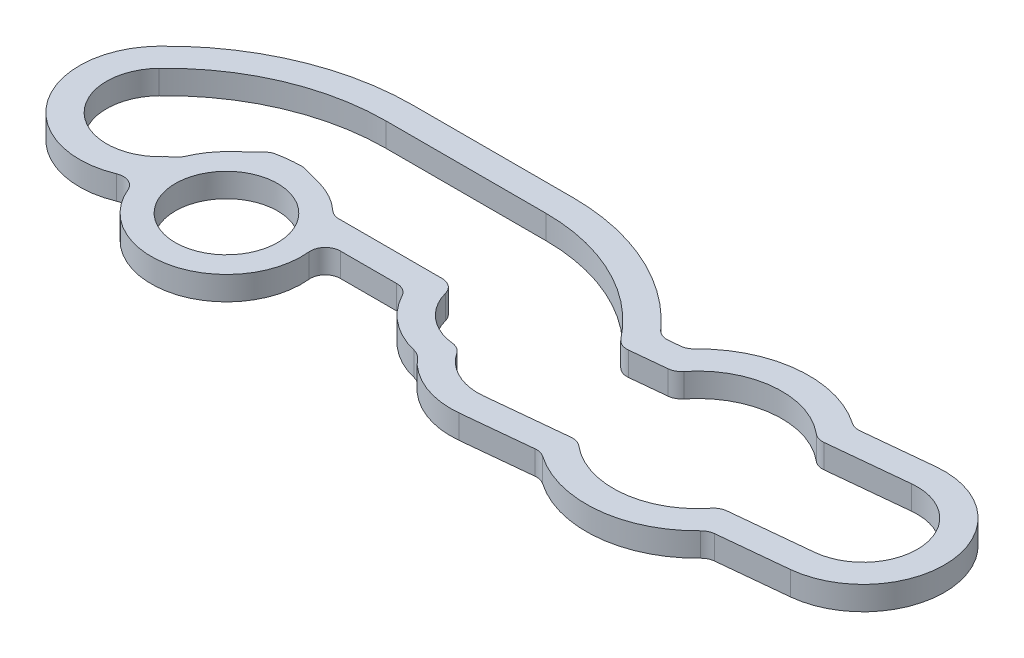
ISO-10303-21;
HEADER;
FILE_DESCRIPTION(('STEP AP214'),'2;1');
FILE_NAME('part.step','',(''),(''),'','','');
FILE_SCHEMA(('AUTOMOTIVE_DESIGN { 1 0 10303 214 1 1 1 1 }'));
ENDSEC;
DATA;
#1=APPLICATION_CONTEXT('core data for automotive mechanical design processes');
#2=APPLICATION_PROTOCOL_DEFINITION('international standard','automotive_design',2000,#1);
#3=PRODUCT_CONTEXT('',#1,'mechanical');
#4=PRODUCT('Part','Part','',(#3));
#5=PRODUCT_RELATED_PRODUCT_CATEGORY('part','',(#4));
#6=PRODUCT_DEFINITION_FORMATION('','',#4);
#7=PRODUCT_DEFINITION_CONTEXT('part definition',#1,'design');
#8=PRODUCT_DEFINITION('design','',#6,#7);
#9=PRODUCT_DEFINITION_SHAPE('','',#8);
#10=(LENGTH_UNIT() NAMED_UNIT(*) SI_UNIT(.MILLI.,.METRE.));
#11=(NAMED_UNIT(*) PLANE_ANGLE_UNIT() SI_UNIT($,.RADIAN.));
#12=(NAMED_UNIT(*) SI_UNIT($,.STERADIAN.) SOLID_ANGLE_UNIT());
#13=UNCERTAINTY_MEASURE_WITH_UNIT(LENGTH_MEASURE(1.E-05),#10,'distance_accuracy_value','');
#14=(GEOMETRIC_REPRESENTATION_CONTEXT(3) GLOBAL_UNCERTAINTY_ASSIGNED_CONTEXT((#13)) GLOBAL_UNIT_ASSIGNED_CONTEXT((#10,
#11,#12)) REPRESENTATION_CONTEXT('',''));
#15=CARTESIAN_POINT('',(0.,0.,0.));
#16=DIRECTION('',(0.,0.,1.));
#17=DIRECTION('',(1.,0.,0.));
#18=AXIS2_PLACEMENT_3D('',#15,#16,#17);
#19=CARTESIAN_POINT('',(24.6666666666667,-51.41,0.));
#20=DIRECTION('',(0.,-1.,0.));
#21=DIRECTION('',(0.,0.,-1.));
#22=AXIS2_PLACEMENT_3D('',#19,#20,#21);
#23=CYLINDRICAL_SURFACE('',#22,2.70000000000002);
#24=CARTESIAN_POINT('',(24.6666666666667,-52.2,0.));
#25=DIRECTION('',(0.,-1.,0.));
#26=DIRECTION('',(0.,0.,-1.));
#27=AXIS2_PLACEMENT_3D('',#24,#25,#26);
#28=CIRCLE('',#27,2.70000000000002);
#29=CARTESIAN_POINT('',(25.6931392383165,-52.2,2.49726932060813));
#30=VERTEX_POINT('',#29);
#31=CARTESIAN_POINT('',(22.7171487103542,-52.2,-1.8679881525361));
#32=VERTEX_POINT('',#31);
#33=EDGE_CURVE('E525',#30,#32,#28,.T.);
#34=ORIENTED_EDGE('',*,*,#33,.F.);
#35=DIRECTION('',(0.,-1.,0.));
#36=VECTOR('',#35,1.);
#37=CARTESIAN_POINT('',(25.6931392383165,-51.41,2.49726932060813));
#38=LINE('',#37,#36);
#39=CARTESIAN_POINT('',(25.6931392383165,-51.41,2.49726932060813));
#40=VERTEX_POINT('',#39);
#41=EDGE_CURVE('E700',#30,#40,#38,.F.);
#42=ORIENTED_EDGE('',*,*,#41,.T.);
#43=CARTESIAN_POINT('',(24.6666666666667,-51.41,0.));
#44=DIRECTION('',(0.,-1.,0.));
#45=DIRECTION('',(0.,0.,-1.));
#46=AXIS2_PLACEMENT_3D('',#43,#44,#45);
#47=CIRCLE('',#46,2.70000000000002);
#48=CARTESIAN_POINT('',(22.7171487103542,-51.41,-1.8679881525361));
#49=VERTEX_POINT('',#48);
#50=EDGE_CURVE('E542',#40,#49,#47,.T.);
#51=ORIENTED_EDGE('',*,*,#50,.T.);
#52=DIRECTION('',(0.,-1.,0.));
#53=VECTOR('',#52,1.);
#54=CARTESIAN_POINT('',(22.7171487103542,-51.41,-1.8679881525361));
#55=LINE('',#54,#53);
#56=EDGE_CURVE('E583',#49,#32,#55,.T.);
#57=ORIENTED_EDGE('',*,*,#56,.T.);
#58=EDGE_LOOP('',(#34,#42,#51,#57));
#59=FACE_BOUND('',#58,.T.);
#60=ADVANCED_FACE('F45',(#59),#23,.T.);
#61=CARTESIAN_POINT('',(28.65,-51.41,1.8));
#62=DIRECTION('',(0.,-1.,0.));
#63=DIRECTION('',(0.,0.,-1.));
#64=AXIS2_PLACEMENT_3D('',#61,#62,#63);
#65=CYLINDRICAL_SURFACE('',#64,2.50000000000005);
#66=CARTESIAN_POINT('',(28.65,-51.41,1.8));
#67=DIRECTION('',(0.,-1.,0.));
#68=DIRECTION('',(0.,0.,-1.));
#69=AXIS2_PLACEMENT_3D('',#66,#67,#68);
#70=CIRCLE('',#69,2.50000000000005);
#71=CARTESIAN_POINT('',(31.1374685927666,-51.41,1.55));
#72=VERTEX_POINT('',#71);
#73=CARTESIAN_POINT('',(26.3443556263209,-51.41,2.76643883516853));
#74=VERTEX_POINT('',#73);
#75=EDGE_CURVE('E580',#72,#74,#70,.T.);
#76=ORIENTED_EDGE('',*,*,#75,.T.);
#77=DIRECTION('',(0.,-1.,0.));
#78=VECTOR('',#77,1.);
#79=CARTESIAN_POINT('',(26.3443556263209,-51.41,2.76643883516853));
#80=LINE('',#79,#78);
#81=CARTESIAN_POINT('',(26.3443556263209,-52.2,2.76643883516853));
#82=VERTEX_POINT('',#81);
#83=EDGE_CURVE('E697',#74,#82,#80,.T.);
#84=ORIENTED_EDGE('',*,*,#83,.T.);
#85=CARTESIAN_POINT('',(28.65,-52.2,1.8));
#86=DIRECTION('',(0.,-1.,0.));
#87=DIRECTION('',(0.,0.,-1.));
#88=AXIS2_PLACEMENT_3D('',#85,#86,#87);
#89=CIRCLE('',#88,2.50000000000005);
#90=CARTESIAN_POINT('',(31.1374685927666,-52.2,1.55));
#91=VERTEX_POINT('',#90);
#92=EDGE_CURVE('E545',#91,#82,#89,.T.);
#93=ORIENTED_EDGE('',*,*,#92,.F.);
#94=DIRECTION('',(0.,-1.,0.));
#95=VECTOR('',#94,1.);
#96=CARTESIAN_POINT('',(31.1374685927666,-51.41,1.55));
#97=LINE('',#96,#95);
#98=EDGE_CURVE('E695',#91,#72,#97,.F.);
#99=ORIENTED_EDGE('',*,*,#98,.T.);
#100=EDGE_LOOP('',(#76,#84,#93,#99));
#101=FACE_BOUND('',#100,.T.);
#102=ADVANCED_FACE('F906',(#101),#65,.T.);
#103=CARTESIAN_POINT('',(33.8253460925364,-51.41,1.));
#104=DIRECTION('',(0.,0.,1.));
#105=DIRECTION('',(1.,0.,0.));
#106=AXIS2_PLACEMENT_3D('',#103,#104,#105);
#107=PLANE('',#106);
#108=DIRECTION('',(-1.,0.,0.));
#109=VECTOR('',#108,1.);
#110=CARTESIAN_POINT('',(33.8253460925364,-51.41,1.));
#111=LINE('',#110,#109);
#112=CARTESIAN_POINT('',(33.5066745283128,-51.41,1.));
#113=VERTEX_POINT('',#112);
#114=CARTESIAN_POINT('',(31.6349623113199,-51.41,1.));
#115=VERTEX_POINT('',#114);
#116=EDGE_CURVE('E577',#113,#115,#111,.T.);
#117=ORIENTED_EDGE('',*,*,#116,.T.);
#118=DIRECTION('',(0.,1.,0.));
#119=VECTOR('',#118,1.);
#120=CARTESIAN_POINT('',(31.6349623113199,-52.2,1.));
#121=LINE('',#120,#119);
#122=CARTESIAN_POINT('',(31.6349623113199,-52.2,1.));
#123=VERTEX_POINT('',#122);
#124=EDGE_CURVE('E704',#115,#123,#121,.F.);
#125=ORIENTED_EDGE('',*,*,#124,.T.);
#126=DIRECTION('',(-1.,0.,0.));
#127=VECTOR('',#126,1.);
#128=CARTESIAN_POINT('',(33.8253460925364,-52.2,1.));
#129=LINE('',#128,#127);
#130=CARTESIAN_POINT('',(33.5066745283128,-52.2,1.));
#131=VERTEX_POINT('',#130);
#132=EDGE_CURVE('E619',#131,#123,#129,.T.);
#133=ORIENTED_EDGE('',*,*,#132,.F.);
#134=DIRECTION('',(0.,1.,0.));
#135=VECTOR('',#134,1.);
#136=CARTESIAN_POINT('',(33.5066745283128,-51.41,1.));
#137=LINE('',#136,#135);
#138=EDGE_CURVE('E702',#131,#113,#137,.T.);
#139=ORIENTED_EDGE('',*,*,#138,.T.);
#140=EDGE_LOOP('',(#117,#125,#133,#139));
#141=FACE_BOUND('',#140,.T.);
#142=ADVANCED_FACE('F816',(#141),#107,.T.);
#143=CARTESIAN_POINT('',(36.3333333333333,-51.41,0.));
#144=DIRECTION('',(0.,-1.,0.));
#145=DIRECTION('',(0.,0.,-1.));
#146=AXIS2_PLACEMENT_3D('',#143,#144,#145);
#147=CYLINDRICAL_SURFACE('',#146,2.7);
#148=CARTESIAN_POINT('',(36.3333333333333,-52.2,0.));
#149=DIRECTION('',(0.,-1.,0.));
#150=DIRECTION('',(0.,0.,-1.));
#151=AXIS2_PLACEMENT_3D('',#148,#149,#150);
#152=CIRCLE('',#151,2.7);
#153=CARTESIAN_POINT('',(35.7129299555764,-52.2,2.62775562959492));
#154=VERTEX_POINT('',#153);
#155=CARTESIAN_POINT('',(33.9483399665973,-52.2,1.265625));
#156=VERTEX_POINT('',#155);
#157=EDGE_CURVE('E616',#154,#156,#152,.T.);
#158=ORIENTED_EDGE('',*,*,#157,.F.);
#159=DIRECTION('',(0.,-1.,0.));
#160=VECTOR('',#159,1.);
#161=CARTESIAN_POINT('',(35.7129299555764,-51.41,2.62775562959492));
#162=LINE('',#161,#160);
#163=CARTESIAN_POINT('',(35.7129299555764,-51.41,2.62775562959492));
#164=VERTEX_POINT('',#163);
#165=EDGE_CURVE('E770',#154,#164,#162,.F.);
#166=ORIENTED_EDGE('',*,*,#165,.T.);
#167=CARTESIAN_POINT('',(36.3333333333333,-51.41,0.));
#168=DIRECTION('',(0.,-1.,0.));
#169=DIRECTION('',(0.,0.,-1.));
#170=AXIS2_PLACEMENT_3D('',#167,#168,#169);
#171=CIRCLE('',#170,2.7);
#172=CARTESIAN_POINT('',(33.9483399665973,-51.41,1.265625));
#173=VERTEX_POINT('',#172);
#174=EDGE_CURVE('E574',#164,#173,#171,.T.);
#175=ORIENTED_EDGE('',*,*,#174,.T.);
#176=DIRECTION('',(0.,-1.,0.));
#177=VECTOR('',#176,1.);
#178=CARTESIAN_POINT('',(33.9483399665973,-51.41,1.265625));
#179=LINE('',#178,#177);
#180=EDGE_CURVE('E767',#173,#156,#179,.T.);
#181=ORIENTED_EDGE('',*,*,#180,.T.);
#182=EDGE_LOOP('',(#158,#166,#175,#181));
#183=FACE_BOUND('',#182,.T.);
#184=ADVANCED_FACE('F824',(#183),#147,.T.);
#185=CARTESIAN_POINT('',(38.,-51.41,1.));
#186=DIRECTION('',(0.,-1.,0.));
#187=DIRECTION('',(0.,0.,-1.));
#188=AXIS2_PLACEMENT_3D('',#185,#186,#187);
#189=CYLINDRICAL_SURFACE('',#188,2.7);
#190=CARTESIAN_POINT('',(38.,-51.41,1.));
#191=DIRECTION('',(0.,-1.,0.));
#192=DIRECTION('',(0.,0.,-1.));
#193=AXIS2_PLACEMENT_3D('',#190,#191,#192);
#194=CIRCLE('',#193,2.7);
#195=CARTESIAN_POINT('',(38.2686600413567,-51.41,3.68660041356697));
#196=VERTEX_POINT('',#195);
#197=CARTESIAN_POINT('',(35.973346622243,-51.41,2.78400562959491));
#198=VERTEX_POINT('',#197);
#199=EDGE_CURVE('E571',#196,#198,#194,.T.);
#200=ORIENTED_EDGE('',*,*,#199,.T.);
#201=DIRECTION('',(0.,-1.,0.));
#202=VECTOR('',#201,1.);
#203=CARTESIAN_POINT('',(35.973346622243,-51.41,2.78400562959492));
#204=LINE('',#203,#202);
#205=CARTESIAN_POINT('',(35.973346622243,-52.2,2.78400562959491));
#206=VERTEX_POINT('',#205);
#207=EDGE_CURVE('E764',#198,#206,#204,.T.);
#208=ORIENTED_EDGE('',*,*,#207,.T.);
#209=CARTESIAN_POINT('',(38.,-52.2,1.));
#210=DIRECTION('',(0.,-1.,0.));
#211=DIRECTION('',(0.,0.,-1.));
#212=AXIS2_PLACEMENT_3D('',#209,#210,#211);
#213=CIRCLE('',#212,2.7);
#214=CARTESIAN_POINT('',(38.2686600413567,-52.2,3.68660041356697));
#215=VERTEX_POINT('',#214);
#216=EDGE_CURVE('E613',#215,#206,#213,.T.);
#217=ORIENTED_EDGE('',*,*,#216,.F.);
#218=DIRECTION('',(0.,-1.,0.));
#219=VECTOR('',#218,1.);
#220=CARTESIAN_POINT('',(38.2686600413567,-51.41,3.68660041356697));
#221=LINE('',#220,#219);
#222=EDGE_CURVE('E624',#196,#215,#221,.T.);
#223=ORIENTED_EDGE('',*,*,#222,.F.);
#224=EDGE_LOOP('',(#200,#208,#217,#223));
#225=FACE_BOUND('',#224,.T.);
#226=ADVANCED_FACE('F833',(#225),#189,.T.);
#227=CARTESIAN_POINT('',(40.7513929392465,-51.41,3.43832712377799));
#228=DIRECTION('',(0.0995037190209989,0.,0.995037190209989));
#229=DIRECTION('',(0.995037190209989,0.,-0.0995037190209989));
#230=AXIS2_PLACEMENT_3D('',#227,#228,#229);
#231=PLANE('',#230);
#232=DIRECTION('',(-0.995037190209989,0.,0.0995037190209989));
#233=VECTOR('',#232,1.);
#234=CARTESIAN_POINT('',(40.7513929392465,-52.2,3.43832712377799));
#235=LINE('',#234,#233);
#236=CARTESIAN_POINT('',(40.5618662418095,-52.2,3.45727979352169));
#237=VERTEX_POINT('',#236);
#238=EDGE_CURVE('E611',#237,#215,#235,.T.);
#239=ORIENTED_EDGE('',*,*,#238,.F.);
#240=DIRECTION('',(0.,1.,0.));
#241=VECTOR('',#240,1.);
#242=CARTESIAN_POINT('',(40.5618662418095,-51.41,3.45727979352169));
#243=LINE('',#242,#241);
#244=CARTESIAN_POINT('',(40.5618662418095,-51.41,3.45727979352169));
#245=VERTEX_POINT('',#244);
#246=EDGE_CURVE('E762',#237,#245,#243,.T.);
#247=ORIENTED_EDGE('',*,*,#246,.T.);
#248=DIRECTION('',(-0.995037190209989,0.,0.0995037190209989));
#249=VECTOR('',#248,1.);
#250=CARTESIAN_POINT('',(40.7513929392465,-51.41,3.43832712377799));
#251=LINE('',#250,#249);
#252=EDGE_CURVE('E569',#245,#196,#251,.T.);
#253=ORIENTED_EDGE('',*,*,#252,.T.);
#254=ORIENTED_EDGE('',*,*,#222,.T.);
#255=EDGE_LOOP('',(#239,#247,#253,#254));
#256=FACE_BOUND('',#255,.T.);
#257=ADVANCED_FACE('F837',(#256),#231,.T.);
#258=CARTESIAN_POINT('',(43.,-51.41,0.5));
#259=DIRECTION('',(0.,-1.,0.));
#260=DIRECTION('',(0.,0.,-1.));
#261=AXIS2_PLACEMENT_3D('',#258,#259,#260);
#262=CYLINDRICAL_SURFACE('',#261,3.7);
#263=CARTESIAN_POINT('',(43.,-52.2,0.5));
#264=DIRECTION('',(0.,-1.,0.));
#265=DIRECTION('',(0.,0.,-1.));
#266=AXIS2_PLACEMENT_3D('',#263,#264,#265);
#267=CIRCLE('',#266,3.7);
#268=CARTESIAN_POINT('',(45.6650621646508,-52.2,3.06660157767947));
#269=VERTEX_POINT('',#268);
#270=CARTESIAN_POINT('',(40.8959492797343,-52.2,3.54351286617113));
#271=VERTEX_POINT('',#270);
#272=EDGE_CURVE('E608',#269,#271,#267,.T.);
#273=ORIENTED_EDGE('',*,*,#272,.F.);
#274=DIRECTION('',(0.,-1.,0.));
#275=VECTOR('',#274,1.);
#276=CARTESIAN_POINT('',(45.6650621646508,-51.41,3.06660157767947));
#277=LINE('',#276,#275);
#278=CARTESIAN_POINT('',(45.6650621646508,-51.41,3.06660157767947));
#279=VERTEX_POINT('',#278);
#280=EDGE_CURVE('E745',#269,#279,#277,.F.);
#281=ORIENTED_EDGE('',*,*,#280,.T.);
#282=CARTESIAN_POINT('',(43.,-51.41,0.5));
#283=DIRECTION('',(0.,-1.,0.));
#284=DIRECTION('',(0.,0.,-1.));
#285=AXIS2_PLACEMENT_3D('',#282,#283,#284);
#286=CIRCLE('',#285,3.7);
#287=CARTESIAN_POINT('',(40.8959492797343,-51.41,3.54351286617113));
#288=VERTEX_POINT('',#287);
#289=EDGE_CURVE('E566',#279,#288,#286,.T.);
#290=ORIENTED_EDGE('',*,*,#289,.T.);
#291=DIRECTION('',(0.,-1.,0.));
#292=VECTOR('',#291,1.);
#293=CARTESIAN_POINT('',(40.8959492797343,-51.41,3.54351286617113));
#294=LINE('',#293,#292);
#295=EDGE_CURVE('E742',#288,#271,#294,.T.);
#296=ORIENTED_EDGE('',*,*,#295,.T.);
#297=EDGE_LOOP('',(#273,#281,#290,#296));
#298=FACE_BOUND('',#297,.T.);
#299=ADVANCED_FACE('F846',(#298),#262,.T.);
#300=CARTESIAN_POINT('',(48.2686600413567,-51.41,2.68660041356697));
#301=DIRECTION('',(0.0995037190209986,0.,0.995037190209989));
#302=DIRECTION('',(0.995037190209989,0.,-0.0995037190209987));
#303=AXIS2_PLACEMENT_3D('',#300,#301,#302);
#304=PLANE('',#303);
#305=DIRECTION('',(-0.995037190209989,0.,0.0995037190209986));
#306=VECTOR('',#305,1.);
#307=CARTESIAN_POINT('',(48.2686600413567,-51.41,2.68660041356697));
#308=LINE('',#307,#306);
#309=CARTESIAN_POINT('',(48.2686600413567,-51.41,2.68660041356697));
#310=VERTEX_POINT('',#309);
#311=CARTESIAN_POINT('',(45.9754538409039,-51.41,2.91592103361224));
#312=VERTEX_POINT('',#311);
#313=EDGE_CURVE('E563',#310,#312,#308,.T.);
#314=ORIENTED_EDGE('',*,*,#313,.T.);
#315=DIRECTION('',(0.,1.,0.));
#316=VECTOR('',#315,1.);
#317=CARTESIAN_POINT('',(45.9754538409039,-52.2,2.91592103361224));
#318=LINE('',#317,#316);
#319=CARTESIAN_POINT('',(45.9754538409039,-52.2,2.91592103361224));
#320=VERTEX_POINT('',#319);
#321=EDGE_CURVE('E739',#312,#320,#318,.F.);
#322=ORIENTED_EDGE('',*,*,#321,.T.);
#323=DIRECTION('',(-0.995037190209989,0.,0.0995037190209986));
#324=VECTOR('',#323,1.);
#325=CARTESIAN_POINT('',(48.2686600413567,-52.2,2.68660041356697));
#326=LINE('',#325,#324);
#327=CARTESIAN_POINT('',(48.2686600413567,-52.2,2.68660041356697));
#328=VERTEX_POINT('',#327);
#329=EDGE_CURVE('E605',#328,#320,#326,.T.);
#330=ORIENTED_EDGE('',*,*,#329,.F.);
#331=DIRECTION('',(0.,-1.,0.));
#332=VECTOR('',#331,1.);
#333=CARTESIAN_POINT('',(48.2686600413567,-51.41,2.68660041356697));
#334=LINE('',#333,#332);
#335=EDGE_CURVE('E628',#310,#328,#334,.T.);
#336=ORIENTED_EDGE('',*,*,#335,.F.);
#337=EDGE_LOOP('',(#314,#322,#330,#336));
#338=FACE_BOUND('',#337,.T.);
#339=ADVANCED_FACE('F854',(#338),#304,.T.);
#340=CARTESIAN_POINT('',(48.,-51.41,0.));
#341=DIRECTION('',(0.,-1.,0.));
#342=DIRECTION('',(0.,0.,-1.));
#343=AXIS2_PLACEMENT_3D('',#340,#341,#342);
#344=CYLINDRICAL_SURFACE('',#343,2.7);
#345=CARTESIAN_POINT('',(48.,-52.2,0.));
#346=DIRECTION('',(0.,-1.,0.));
#347=DIRECTION('',(0.,0.,-1.));
#348=AXIS2_PLACEMENT_3D('',#345,#346,#347);
#349=CIRCLE('',#348,2.7);
#350=CARTESIAN_POINT('',(47.7313399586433,-52.2,-2.68660041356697));
#351=VERTEX_POINT('',#350);
#352=EDGE_CURVE('E602',#351,#328,#349,.T.);
#353=ORIENTED_EDGE('',*,*,#352,.F.);
#354=DIRECTION('',(0.,-1.,0.));
#355=VECTOR('',#354,1.);
#356=CARTESIAN_POINT('',(47.7313399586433,-51.41,-2.68660041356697));
#357=LINE('',#356,#355);
#358=CARTESIAN_POINT('',(47.7313399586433,-51.41,-2.68660041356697));
#359=VERTEX_POINT('',#358);
#360=EDGE_CURVE('E630',#359,#351,#357,.T.);
#361=ORIENTED_EDGE('',*,*,#360,.F.);
#362=CARTESIAN_POINT('',(48.,-51.41,0.));
#363=DIRECTION('',(0.,-1.,0.));
#364=DIRECTION('',(0.,0.,-1.));
#365=AXIS2_PLACEMENT_3D('',#362,#363,#364);
#366=CIRCLE('',#365,2.7);
#367=EDGE_CURVE('E560',#359,#310,#366,.T.);
#368=ORIENTED_EDGE('',*,*,#367,.T.);
#369=ORIENTED_EDGE('',*,*,#335,.T.);
#370=EDGE_LOOP('',(#353,#361,#368,#369));
#371=FACE_BOUND('',#370,.T.);
#372=ADVANCED_FACE('F861',(#371),#344,.T.);
#373=CARTESIAN_POINT('',(45.2486070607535,-51.41,-2.43832712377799));
#374=DIRECTION('',(-0.0995037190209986,0.,-0.995037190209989));
#375=DIRECTION('',(-0.995037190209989,0.,0.0995037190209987));
#376=AXIS2_PLACEMENT_3D('',#373,#374,#375);
#377=PLANE('',#376);
#378=DIRECTION('',(0.995037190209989,0.,-0.0995037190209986));
#379=VECTOR('',#378,1.);
#380=CARTESIAN_POINT('',(45.2486070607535,-52.2,-2.43832712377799));
#381=LINE('',#380,#379);
#382=CARTESIAN_POINT('',(45.4381337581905,-52.2,-2.45727979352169));
#383=VERTEX_POINT('',#382);
#384=EDGE_CURVE('E600',#383,#351,#381,.T.);
#385=ORIENTED_EDGE('',*,*,#384,.F.);
#386=DIRECTION('',(0.,1.,0.));
#387=VECTOR('',#386,1.);
#388=CARTESIAN_POINT('',(45.4381337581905,-51.41,-2.45727979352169));
#389=LINE('',#388,#387);
#390=CARTESIAN_POINT('',(45.4381337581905,-51.41,-2.45727979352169));
#391=VERTEX_POINT('',#390);
#392=EDGE_CURVE('E712',#383,#391,#389,.T.);
#393=ORIENTED_EDGE('',*,*,#392,.T.);
#394=DIRECTION('',(0.995037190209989,0.,-0.0995037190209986));
#395=VECTOR('',#394,1.);
#396=CARTESIAN_POINT('',(45.2486070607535,-51.41,-2.43832712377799));
#397=LINE('',#396,#395);
#398=EDGE_CURVE('E558',#391,#359,#397,.T.);
#399=ORIENTED_EDGE('',*,*,#398,.T.);
#400=ORIENTED_EDGE('',*,*,#360,.T.);
#401=EDGE_LOOP('',(#385,#393,#399,#400));
#402=FACE_BOUND('',#401,.T.);
#403=ADVANCED_FACE('F864',(#402),#377,.T.);
#404=CARTESIAN_POINT('',(43.,-51.41,0.5));
#405=DIRECTION('',(0.,-1.,0.));
#406=DIRECTION('',(0.,0.,-1.));
#407=AXIS2_PLACEMENT_3D('',#404,#405,#406);
#408=CYLINDRICAL_SURFACE('',#407,3.7);
#409=CARTESIAN_POINT('',(43.,-51.41,0.5));
#410=DIRECTION('',(0.,-1.,0.));
#411=DIRECTION('',(0.,0.,-1.));
#412=AXIS2_PLACEMENT_3D('',#409,#410,#411);
#413=CIRCLE('',#412,3.7);
#414=CARTESIAN_POINT('',(40.3349378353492,-51.41,-2.06660157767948));
#415=VERTEX_POINT('',#414);
#416=CARTESIAN_POINT('',(45.1040507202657,-51.41,-2.54351286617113));
#417=VERTEX_POINT('',#416);
#418=EDGE_CURVE('E555',#415,#417,#413,.T.);
#419=ORIENTED_EDGE('',*,*,#418,.T.);
#420=DIRECTION('',(0.,-1.,0.));
#421=VECTOR('',#420,1.);
#422=CARTESIAN_POINT('',(45.1040507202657,-51.41,-2.54351286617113));
#423=LINE('',#422,#421);
#424=CARTESIAN_POINT('',(45.1040507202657,-52.2,-2.54351286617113));
#425=VERTEX_POINT('',#424);
#426=EDGE_CURVE('E709',#417,#425,#423,.T.);
#427=ORIENTED_EDGE('',*,*,#426,.T.);
#428=CARTESIAN_POINT('',(43.,-52.2,0.5));
#429=DIRECTION('',(0.,-1.,0.));
#430=DIRECTION('',(0.,0.,-1.));
#431=AXIS2_PLACEMENT_3D('',#428,#429,#430);
#432=CIRCLE('',#431,3.7);
#433=CARTESIAN_POINT('',(40.3349378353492,-52.2,-2.06660157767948));
#434=VERTEX_POINT('',#433);
#435=EDGE_CURVE('E597',#434,#425,#432,.T.);
#436=ORIENTED_EDGE('',*,*,#435,.F.);
#437=DIRECTION('',(0.,-1.,0.));
#438=VECTOR('',#437,1.);
#439=CARTESIAN_POINT('',(40.3349378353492,-51.41,-2.06660157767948));
#440=LINE('',#439,#438);
#441=EDGE_CURVE('E707',#434,#415,#440,.F.);
#442=ORIENTED_EDGE('',*,*,#441,.T.);
#443=EDGE_LOOP('',(#419,#427,#436,#442));
#444=FACE_BOUND('',#443,.T.);
#445=ADVANCED_FACE('F872',(#444),#408,.T.);
#446=CARTESIAN_POINT('',(39.3967491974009,-51.41,-1.85314133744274));
#447=DIRECTION('',(-0.0995037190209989,0.,-0.995037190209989));
#448=DIRECTION('',(-0.995037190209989,0.,0.0995037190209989));
#449=AXIS2_PLACEMENT_3D('',#446,#447,#448);
#450=PLANE('',#449);
#451=DIRECTION('',(0.995037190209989,0.,-0.0995037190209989));
#452=VECTOR('',#451,1.);
#453=CARTESIAN_POINT('',(39.3967491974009,-51.41,-1.85314133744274));
#454=LINE('',#453,#452);
#455=CARTESIAN_POINT('',(39.6553244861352,-51.41,-1.87899886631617));
#456=VERTEX_POINT('',#455);
#457=CARTESIAN_POINT('',(40.0245461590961,-51.41,-1.91592103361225));
#458=VERTEX_POINT('',#457);
#459=EDGE_CURVE('E553',#456,#458,#454,.T.);
#460=ORIENTED_EDGE('',*,*,#459,.T.);
#461=DIRECTION('',(0.,1.,0.));
#462=VECTOR('',#461,1.);
#463=CARTESIAN_POINT('',(40.0245461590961,-52.2,-1.91592103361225));
#464=LINE('',#463,#462);
#465=CARTESIAN_POINT('',(40.0245461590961,-52.2,-1.91592103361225));
#466=VERTEX_POINT('',#465);
#467=EDGE_CURVE('E716',#458,#466,#464,.F.);
#468=ORIENTED_EDGE('',*,*,#467,.T.);
#469=DIRECTION('',(0.995037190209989,0.,-0.0995037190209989));
#470=VECTOR('',#469,1.);
#471=CARTESIAN_POINT('',(39.3967491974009,-52.2,-1.85314133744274));
#472=LINE('',#471,#470);
#473=CARTESIAN_POINT('',(39.6553244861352,-52.2,-1.87899886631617));
#474=VERTEX_POINT('',#473);
#475=EDGE_CURVE('E594',#474,#466,#472,.T.);
#476=ORIENTED_EDGE('',*,*,#475,.F.);
#477=DIRECTION('',(0.,1.,0.));
#478=VECTOR('',#477,1.);
#479=CARTESIAN_POINT('',(39.6553244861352,-51.41,-1.87899886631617));
#480=LINE('',#479,#478);
#481=EDGE_CURVE('E714',#474,#456,#480,.T.);
#482=ORIENTED_EDGE('',*,*,#481,.T.);
#483=EDGE_LOOP('',(#460,#468,#476,#482));
#484=FACE_BOUND('',#483,.T.);
#485=ADVANCED_FACE('F879',(#484),#450,.T.);
#486=CARTESIAN_POINT('',(33.9659422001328,-51.41,2.66363376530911));
#487=DIRECTION('',(0.,-1.,0.));
#488=DIRECTION('',(0.,0.,-1.));
#489=AXIS2_PLACEMENT_3D('',#486,#487,#488);
#490=CYLINDRICAL_SURFACE('',#489,7.06363376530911);
#491=CARTESIAN_POINT('',(33.9659422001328,-51.41,2.66363376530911));
#492=DIRECTION('',(0.,-1.,0.));
#493=DIRECTION('',(0.,0.,-1.));
#494=AXIS2_PLACEMENT_3D('',#491,#492,#493);
#495=CIRCLE('',#494,7.06363376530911);
#496=CARTESIAN_POINT('',(33.9659422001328,-51.41,-4.4));
#497=VERTEX_POINT('',#496);
#498=CARTESIAN_POINT('',(39.2327603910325,-51.41,-2.04333427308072));
#499=VERTEX_POINT('',#498);
#500=EDGE_CURVE('E551',#497,#499,#495,.T.);
#501=ORIENTED_EDGE('',*,*,#500,.T.);
#502=DIRECTION('',(0.,-1.,0.));
#503=VECTOR('',#502,1.);
#504=CARTESIAN_POINT('',(39.2327603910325,-51.41,-2.04333427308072));
#505=LINE('',#504,#503);
#506=CARTESIAN_POINT('',(39.2327603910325,-52.2,-2.04333427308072));
#507=VERTEX_POINT('',#506);
#508=EDGE_CURVE('E719',#499,#507,#505,.T.);
#509=ORIENTED_EDGE('',*,*,#508,.T.);
#510=CARTESIAN_POINT('',(33.9659422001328,-52.2,2.66363376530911));
#511=DIRECTION('',(0.,-1.,0.));
#512=DIRECTION('',(0.,0.,-1.));
#513=AXIS2_PLACEMENT_3D('',#510,#511,#512);
#514=CIRCLE('',#513,7.06363376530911);
#515=CARTESIAN_POINT('',(33.9659422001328,-52.2,-4.4));
#516=VERTEX_POINT('',#515);
#517=EDGE_CURVE('E591',#516,#507,#514,.T.);
#518=ORIENTED_EDGE('',*,*,#517,.F.);
#519=DIRECTION('',(0.,-1.,0.));
#520=VECTOR('',#519,1.);
#521=CARTESIAN_POINT('',(33.9659422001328,-51.41,-4.4));
#522=LINE('',#521,#520);
#523=EDGE_CURVE('E633',#497,#516,#522,.T.);
#524=ORIENTED_EDGE('',*,*,#523,.F.);
#525=EDGE_LOOP('',(#501,#509,#518,#524));
#526=FACE_BOUND('',#525,.T.);
#527=ADVANCED_FACE('F886',(#526),#490,.T.);
#528=CARTESIAN_POINT('',(28.65,-51.41,-4.4));
#529=DIRECTION('',(0.,0.,-1.));
#530=DIRECTION('',(-1.,0.,0.));
#531=AXIS2_PLACEMENT_3D('',#528,#529,#530);
#532=PLANE('',#531);
#533=DIRECTION('',(1.,0.,0.));
#534=VECTOR('',#533,1.);
#535=CARTESIAN_POINT('',(28.65,-52.2,-4.4));
#536=LINE('',#535,#534);
#537=CARTESIAN_POINT('',(28.65,-52.2,-4.4));
#538=VERTEX_POINT('',#537);
#539=EDGE_CURVE('E588',#538,#516,#536,.T.);
#540=ORIENTED_EDGE('',*,*,#539,.F.);
#541=DIRECTION('',(0.,-1.,0.));
#542=VECTOR('',#541,1.);
#543=CARTESIAN_POINT('',(28.65,-51.41,-4.4));
#544=LINE('',#543,#542);
#545=CARTESIAN_POINT('',(28.65,-51.41,-4.4));
#546=VERTEX_POINT('',#545);
#547=EDGE_CURVE('E635',#546,#538,#544,.T.);
#548=ORIENTED_EDGE('',*,*,#547,.F.);
#549=DIRECTION('',(1.,0.,0.));
#550=VECTOR('',#549,1.);
#551=CARTESIAN_POINT('',(28.65,-51.41,-4.4));
#552=LINE('',#551,#550);
#553=EDGE_CURVE('E548',#546,#497,#552,.T.);
#554=ORIENTED_EDGE('',*,*,#553,.T.);
#555=ORIENTED_EDGE('',*,*,#523,.T.);
#556=EDGE_LOOP('',(#540,#548,#554,#555));
#557=FACE_BOUND('',#556,.T.);
#558=ADVANCED_FACE('F890',(#557),#532,.T.);
#559=CARTESIAN_POINT('',(28.65,-51.41,3.81674836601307));
#560=DIRECTION('',(0.,-1.,0.));
#561=DIRECTION('',(0.,0.,-1.));
#562=AXIS2_PLACEMENT_3D('',#559,#560,#561);
#563=CYLINDRICAL_SURFACE('',#562,8.21674836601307);
#564=CARTESIAN_POINT('',(28.65,-52.2,3.81674836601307));
#565=DIRECTION('',(0.,-1.,0.));
#566=DIRECTION('',(0.,0.,-1.));
#567=AXIS2_PLACEMENT_3D('',#564,#565,#566);
#568=CIRCLE('',#567,8.21674836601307);
#569=EDGE_CURVE('E585',#32,#538,#568,.T.);
#570=ORIENTED_EDGE('',*,*,#569,.F.);
#571=ORIENTED_EDGE('',*,*,#56,.F.);
#572=CARTESIAN_POINT('',(28.65,-51.41,3.81674836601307));
#573=DIRECTION('',(0.,-1.,0.));
#574=DIRECTION('',(0.,0.,-1.));
#575=AXIS2_PLACEMENT_3D('',#572,#573,#574);
#576=CIRCLE('',#575,8.21674836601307);
#577=EDGE_CURVE('E544',#49,#546,#576,.T.);
#578=ORIENTED_EDGE('',*,*,#577,.T.);
#579=ORIENTED_EDGE('',*,*,#547,.T.);
#580=EDGE_LOOP('',(#570,#571,#578,#579));
#581=FACE_BOUND('',#580,.T.);
#582=ADVANCED_FACE('F895',(#581),#563,.T.);
#583=CARTESIAN_POINT('',(24.6666666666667,-51.41,0.));
#584=DIRECTION('',(0.,-1.,0.));
#585=DIRECTION('',(0.,0.,-1.));
#586=AXIS2_PLACEMENT_3D('',#583,#584,#585);
#587=PLANE('',#586);
#588=CARTESIAN_POINT('',(28.65,-51.41,1.8));
#589=DIRECTION('',(0.,1.,0.));
#590=DIRECTION('',(0.,0.,1.));
#591=AXIS2_PLACEMENT_3D('',#588,#589,#590);
#592=CIRCLE('',#591,1.7);
#593=CARTESIAN_POINT('',(28.65,-51.41,3.5));
#594=VERTEX_POINT('',#593);
#595=EDGE_CURVE('E471',#594,#594,#592,.T.);
#596=ORIENTED_EDGE('',*,*,#595,.F.);
#597=EDGE_LOOP('',(#596));
#598=FACE_BOUND('',#597,.T.);
#599=CARTESIAN_POINT('',(28.65,-51.41,3.81674836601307));
#600=DIRECTION('',(0.,1.,0.));
#601=DIRECTION('',(0.,0.,-1.));
#602=AXIS2_PLACEMENT_3D('',#599,#600,#601);
#603=CIRCLE('',#602,4.61674836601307);
#604=CARTESIAN_POINT('',(28.5458118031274,-51.41,-0.79882421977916));
#605=VERTEX_POINT('',#604);
#606=CARTESIAN_POINT('',(27.776015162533,-51.41,-0.716519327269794));
#607=VERTEX_POINT('',#606);
#608=EDGE_CURVE('E422',#605,#607,#603,.T.);
#609=ORIENTED_EDGE('',*,*,#608,.T.);
#610=CARTESIAN_POINT('',(27.8706688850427,-51.41,-0.225560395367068));
#611=DIRECTION('',(0.,-1.,0.));
#612=DIRECTION('',(0.,0.,-1.));
#613=AXIS2_PLACEMENT_3D('',#610,#611,#612);
#614=CIRCLE('',#613,0.5);
#615=CARTESIAN_POINT('',(27.5240066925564,-51.41,-0.585873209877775));
#616=VERTEX_POINT('',#615);
#617=EDGE_CURVE('E692',#607,#616,#614,.F.);
#618=ORIENTED_EDGE('',*,*,#617,.T.);
#619=DIRECTION('',(-0.720625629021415,0.,0.693324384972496));
#620=VECTOR('',#619,1.);
#621=CARTESIAN_POINT('',(27.6273652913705,-51.41,-0.685316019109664));
#622=LINE('',#621,#620);
#623=CARTESIAN_POINT('',(26.9166890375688,-51.41,-0.00156407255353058));
#624=VERTEX_POINT('',#623);
#625=EDGE_CURVE('E424',#616,#624,#622,.T.);
#626=ORIENTED_EDGE('',*,*,#625,.T.);
#627=CARTESIAN_POINT('',(28.65,-51.41,1.8));
#628=DIRECTION('',(0.,1.,0.));
#629=DIRECTION('',(0.,0.,-1.));
#630=AXIS2_PLACEMENT_3D('',#627,#628,#629);
#631=CIRCLE('',#630,2.5);
#632=CARTESIAN_POINT('',(26.3474820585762,-51.41,0.82613598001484));
#633=VERTEX_POINT('',#632);
#634=EDGE_CURVE('E429',#624,#633,#631,.T.);
#635=ORIENTED_EDGE('',*,*,#634,.T.);
#636=CARTESIAN_POINT('',(25.8869784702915,-51.41,0.631363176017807));
#637=DIRECTION('',(0.,-1.,0.));
#638=DIRECTION('',(0.,0.,-1.));
#639=AXIS2_PLACEMENT_3D('',#636,#637,#638);
#640=CIRCLE('',#639,0.5);
#641=CARTESIAN_POINT('',(26.2146031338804,-51.41,1.00906951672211));
#642=VERTEX_POINT('',#641);
#643=EDGE_CURVE('E774',#633,#642,#640,.T.);
#644=ORIENTED_EDGE('',*,*,#643,.T.);
#645=CARTESIAN_POINT('',(28.65,-51.41,3.81674836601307));
#646=DIRECTION('',(0.,1.,0.));
#647=DIRECTION('',(0.,0.,-1.));
#648=AXIS2_PLACEMENT_3D('',#645,#646,#647);
#649=CIRCLE('',#648,3.71674836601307);
#650=CARTESIAN_POINT('',(25.9663453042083,-51.41,1.24532543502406));
#651=VERTEX_POINT('',#650);
#652=EDGE_CURVE('E432',#642,#651,#649,.T.);
#653=ORIENTED_EDGE('',*,*,#652,.T.);
#654=CARTESIAN_POINT('',(24.6666666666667,-51.41,0.));
#655=DIRECTION('',(0.,-1.,0.));
#656=DIRECTION('',(0.,0.,-1.));
#657=AXIS2_PLACEMENT_3D('',#654,#655,#656);
#658=CIRCLE('',#657,1.8);
#659=CARTESIAN_POINT('',(23.366988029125,-51.41,-1.24532543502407));
#660=VERTEX_POINT('',#659);
#661=EDGE_CURVE('E434',#651,#660,#658,.T.);
#662=ORIENTED_EDGE('',*,*,#661,.T.);
#663=CARTESIAN_POINT('',(28.65,-51.41,3.81674836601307));
#664=DIRECTION('',(0.,-1.,0.));
#665=DIRECTION('',(0.,0.,-1.));
#666=AXIS2_PLACEMENT_3D('',#663,#664,#665);
#667=CIRCLE('',#666,7.31674836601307);
#668=CARTESIAN_POINT('',(28.65,-51.41,-3.5));
#669=VERTEX_POINT('',#668);
#670=EDGE_CURVE('E437',#660,#669,#667,.T.);
#671=ORIENTED_EDGE('',*,*,#670,.T.);
#672=DIRECTION('',(1.,0.,0.));
#673=VECTOR('',#672,1.);
#674=CARTESIAN_POINT('',(28.65,-51.41,-3.5));
#675=LINE('',#674,#673);
#676=CARTESIAN_POINT('',(33.9659422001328,-51.41,-3.5));
#677=VERTEX_POINT('',#676);
#678=EDGE_CURVE('E440',#669,#677,#675,.T.);
#679=ORIENTED_EDGE('',*,*,#678,.T.);
#680=CARTESIAN_POINT('',(33.9659422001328,-51.41,2.66363376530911));
#681=DIRECTION('',(0.,-1.,0.));
#682=DIRECTION('',(0.,0.,-1.));
#683=AXIS2_PLACEMENT_3D('',#680,#681,#682);
#684=CIRCLE('',#683,6.16363376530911);
#685=CARTESIAN_POINT('',(38.8267967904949,-51.41,-1.12615169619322));
#686=VERTEX_POINT('',#685);
#687=EDGE_CURVE('E443',#677,#686,#684,.T.);
#688=ORIENTED_EDGE('',*,*,#687,.T.);
#689=CARTESIAN_POINT('',(39.2211140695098,-51.41,-1.43358279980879));
#690=DIRECTION('',(0.,-1.,0.));
#691=DIRECTION('',(0.,0.,-1.));
#692=AXIS2_PLACEMENT_3D('',#689,#690,#691);
#693=CIRCLE('',#692,0.5);
#694=CARTESIAN_POINT('',(39.2708659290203,-51.41,-0.936064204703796));
#695=VERTEX_POINT('',#694);
#696=EDGE_CURVE('E676',#686,#695,#693,.F.);
#697=ORIENTED_EDGE('',*,*,#696,.T.);
#698=DIRECTION('',(0.995037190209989,0.,-0.0995037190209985));
#699=VECTOR('',#698,1.);
#700=CARTESIAN_POINT('',(38.9893325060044,-51.41,-0.90791086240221));
#701=LINE('',#700,#699);
#702=CARTESIAN_POINT('',(40.4662055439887,-51.41,-1.05559816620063));
#703=VERTEX_POINT('',#702);
#704=EDGE_CURVE('E446',#695,#703,#701,.T.);
#705=ORIENTED_EDGE('',*,*,#704,.T.);
#706=CARTESIAN_POINT('',(40.4164536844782,-51.41,-1.55311676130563));
#707=DIRECTION('',(0.,-1.,0.));
#708=DIRECTION('',(0.,0.,-1.));
#709=AXIS2_PLACEMENT_3D('',#706,#707,#708);
#710=CIRCLE('',#709,0.5);
#711=CARTESIAN_POINT('',(40.8079000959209,-51.41,-1.24203846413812));
#712=VERTEX_POINT('',#711);
#713=EDGE_CURVE('E678',#703,#712,#710,.F.);
#714=ORIENTED_EDGE('',*,*,#713,.T.);
#715=CARTESIAN_POINT('',(43.,-51.41,0.5));
#716=DIRECTION('',(0.,-1.,0.));
#717=DIRECTION('',(0.,0.,-1.));
#718=AXIS2_PLACEMENT_3D('',#715,#716,#717);
#719=CIRCLE('',#718,2.80000000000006);
#720=CARTESIAN_POINT('',(44.8037338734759,-51.41,-1.64162184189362));
#721=VERTEX_POINT('',#720);
#722=EDGE_CURVE('E449',#712,#721,#719,.T.);
#723=ORIENTED_EDGE('',*,*,#722,.T.);
#724=CARTESIAN_POINT('',(45.1258292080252,-51.41,-2.02405431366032));
#725=DIRECTION('',(0.,-1.,0.));
#726=DIRECTION('',(0.,0.,-1.));
#727=AXIS2_PLACEMENT_3D('',#724,#725,#726);
#728=CIRCLE('',#727,0.5);
#729=CARTESIAN_POINT('',(45.1755810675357,-51.41,-1.52653571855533));
#730=VERTEX_POINT('',#729);
#731=EDGE_CURVE('E680',#721,#730,#728,.F.);
#732=ORIENTED_EDGE('',*,*,#731,.T.);
#733=DIRECTION('',(0.995037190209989,0.,-0.0995037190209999));
#734=VECTOR('',#733,1.);
#735=CARTESIAN_POINT('',(44.9550103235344,-51.41,-1.5044786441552));
#736=LINE('',#735,#734);
#737=CARTESIAN_POINT('',(47.8208933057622,-51.41,-1.79106694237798));
#738=VERTEX_POINT('',#737);
#739=EDGE_CURVE('E452',#730,#738,#736,.T.);
#740=ORIENTED_EDGE('',*,*,#739,.T.);
#741=CARTESIAN_POINT('',(48.,-51.41,0.));
#742=DIRECTION('',(0.,-1.,0.));
#743=DIRECTION('',(0.,0.,-1.));
#744=AXIS2_PLACEMENT_3D('',#741,#742,#743);
#745=CIRCLE('',#744,1.8);
#746=CARTESIAN_POINT('',(48.1791066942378,-51.41,1.79106694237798));
#747=VERTEX_POINT('',#746);
#748=EDGE_CURVE('E454',#738,#747,#745,.T.);
#749=ORIENTED_EDGE('',*,*,#748,.T.);
#750=DIRECTION('',(-0.995037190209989,0.,0.0995037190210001));
#751=VECTOR('',#750,1.);
#752=CARTESIAN_POINT('',(48.1791066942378,-51.41,1.79106694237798));
#753=LINE('',#752,#751);
#754=CARTESIAN_POINT('',(45.5337944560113,-51.41,2.05559816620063));
#755=VERTEX_POINT('',#754);
#756=EDGE_CURVE('E457',#747,#755,#753,.T.);
#757=ORIENTED_EDGE('',*,*,#756,.T.);
#758=CARTESIAN_POINT('',(45.5835463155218,-51.41,2.55311676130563));
#759=DIRECTION('',(0.,-1.,0.));
#760=DIRECTION('',(0.,0.,-1.));
#761=AXIS2_PLACEMENT_3D('',#758,#759,#760);
#762=CIRCLE('',#761,0.5);
#763=CARTESIAN_POINT('',(45.1920999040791,-51.41,2.24203846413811));
#764=VERTEX_POINT('',#763);
#765=EDGE_CURVE('E688',#755,#764,#762,.F.);
#766=ORIENTED_EDGE('',*,*,#765,.T.);
#767=CARTESIAN_POINT('',(43.,-51.41,0.5));
#768=DIRECTION('',(0.,-1.,0.));
#769=DIRECTION('',(0.,0.,-1.));
#770=AXIS2_PLACEMENT_3D('',#767,#768,#769);
#771=CIRCLE('',#770,2.80000000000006);
#772=CARTESIAN_POINT('',(41.1962661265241,-51.41,2.64162184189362));
#773=VERTEX_POINT('',#772);
#774=EDGE_CURVE('E460',#764,#773,#771,.T.);
#775=ORIENTED_EDGE('',*,*,#774,.T.);
#776=CARTESIAN_POINT('',(40.8741707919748,-51.41,3.02405431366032));
#777=DIRECTION('',(0.,-1.,0.));
#778=DIRECTION('',(0.,0.,-1.));
#779=AXIS2_PLACEMENT_3D('',#776,#777,#778);
#780=CIRCLE('',#779,0.5);
#781=CARTESIAN_POINT('',(40.8244189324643,-51.41,2.52653571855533));
#782=VERTEX_POINT('',#781);
#783=EDGE_CURVE('E686',#773,#782,#780,.F.);
#784=ORIENTED_EDGE('',*,*,#783,.T.);
#785=DIRECTION('',(-0.995037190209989,0.,0.0995037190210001));
#786=VECTOR('',#785,1.);
#787=CARTESIAN_POINT('',(41.0449896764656,-51.41,2.5044786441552));
#788=LINE('',#787,#786);
#789=CARTESIAN_POINT('',(38.1791066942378,-51.41,2.79106694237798));
#790=VERTEX_POINT('',#789);
#791=EDGE_CURVE('E463',#782,#790,#788,.T.);
#792=ORIENTED_EDGE('',*,*,#791,.T.);
#793=CARTESIAN_POINT('',(38.,-51.41,1.));
#794=DIRECTION('',(0.,-1.,0.));
#795=DIRECTION('',(0.,0.,-1.));
#796=AXIS2_PLACEMENT_3D('',#793,#794,#795);
#797=CIRCLE('',#796,1.8);
#798=CARTESIAN_POINT('',(36.5084644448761,-51.41,2.00763172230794));
#799=VERTEX_POINT('',#798);
#800=EDGE_CURVE('E417',#790,#799,#797,.T.);
#801=ORIENTED_EDGE('',*,*,#800,.T.);
#802=CARTESIAN_POINT('',(36.0941490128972,-51.41,2.28752942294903));
#803=DIRECTION('',(0.,-1.,0.));
#804=DIRECTION('',(0.,0.,-1.));
#805=AXIS2_PLACEMENT_3D('',#802,#803,#804);
#806=CIRCLE('',#805,0.5);
#807=CARTESIAN_POINT('',(36.1461456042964,-51.41,1.79024041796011));
#808=VERTEX_POINT('',#807);
#809=EDGE_CURVE('E684',#799,#808,#806,.F.);
#810=ORIENTED_EDGE('',*,*,#809,.T.);
#811=CARTESIAN_POINT('',(36.3333333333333,-51.41,0.));
#812=DIRECTION('',(0.,-1.,0.));
#813=DIRECTION('',(0.,0.,-1.));
#814=AXIS2_PLACEMENT_3D('',#811,#812,#813);
#815=CIRCLE('',#814,1.8);
#816=CARTESIAN_POINT('',(34.5956600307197,-51.41,0.469565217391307));
#817=VERTEX_POINT('',#816);
#818=EDGE_CURVE('E521',#808,#817,#815,.T.);
#819=ORIENTED_EDGE('',*,*,#818,.T.);
#820=CARTESIAN_POINT('',(34.1129730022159,-51.41,0.600000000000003));
#821=DIRECTION('',(0.,-1.,0.));
#822=DIRECTION('',(0.,0.,-1.));
#823=AXIS2_PLACEMENT_3D('',#820,#821,#822);
#824=CIRCLE('',#823,0.5);
#825=CARTESIAN_POINT('',(34.1129730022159,-51.41,0.100000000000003));
#826=VERTEX_POINT('',#825);
#827=EDGE_CURVE('E682',#817,#826,#824,.F.);
#828=ORIENTED_EDGE('',*,*,#827,.T.);
#829=DIRECTION('',(-1.,0.,0.));
#830=VECTOR('',#829,1.);
#831=CARTESIAN_POINT('',(34.5361132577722,-51.41,0.100000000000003));
#832=LINE('',#831,#830);
#833=CARTESIAN_POINT('',(30.6896078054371,-51.41,0.100000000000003));
#834=VERTEX_POINT('',#833);
#835=EDGE_CURVE('E406',#826,#834,#832,.T.);
#836=ORIENTED_EDGE('',*,*,#835,.T.);
#837=CARTESIAN_POINT('',(30.6896078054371,-51.41,-0.399999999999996));
#838=DIRECTION('',(0.,-1.,0.));
#839=DIRECTION('',(0.,0.,-1.));
#840=AXIS2_PLACEMENT_3D('',#837,#838,#839);
#841=CIRCLE('',#840,0.5);
#842=CARTESIAN_POINT('',(30.3496731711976,-51.41,-0.0333333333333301));
#843=VERTEX_POINT('',#842);
#844=EDGE_CURVE('E402',#834,#843,#841,.T.);
#845=ORIENTED_EDGE('',*,*,#844,.T.);
#846=CARTESIAN_POINT('',(28.65,-51.41,1.8));
#847=DIRECTION('',(0.,1.,0.));
#848=DIRECTION('',(0.,0.,1.));
#849=AXIS2_PLACEMENT_3D('',#846,#847,#848);
#850=CIRCLE('',#849,2.5);
#851=CARTESIAN_POINT('',(29.3098486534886,-51.41,-0.611348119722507));
#852=VERTEX_POINT('',#851);
#853=EDGE_CURVE('E393',#843,#852,#850,.T.);
#854=ORIENTED_EDGE('',*,*,#853,.T.);
#855=DIRECTION('',(-0.964539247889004,0.,-0.263939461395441));
#856=VECTOR('',#855,1.);
#857=CARTESIAN_POINT('',(29.3098486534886,-51.41,-0.611348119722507));
#858=LINE('',#857,#856);
#859=CARTESIAN_POINT('',(28.6890652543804,-51.41,-0.781221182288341));
#860=VERTEX_POINT('',#859);
#861=EDGE_CURVE('E398',#852,#860,#858,.T.);
#862=ORIENTED_EDGE('',*,*,#861,.T.);
#863=CARTESIAN_POINT('',(28.5570955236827,-51.41,-0.298951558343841));
#864=DIRECTION('',(0.,-1.,0.));
#865=DIRECTION('',(0.,0.,-1.));
#866=AXIS2_PLACEMENT_3D('',#863,#864,#865);
#867=CIRCLE('',#866,0.5);
#868=EDGE_CURVE('E690',#860,#605,#867,.F.);
#869=ORIENTED_EDGE('',*,*,#868,.T.);
#870=EDGE_LOOP('',(#609,#618,#626,#635,#644,#653,#662,#671,#679,#688,#697,#705,#714,#723,#732,
#740,#749,#757,#766,#775,#784,#792,#801,#810,#819,#828,#836,#845,#854,#862,#869));
#871=FACE_BOUND('',#870,.T.);
#872=ORIENTED_EDGE('',*,*,#50,.F.);
#873=CARTESIAN_POINT('',(25.883226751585,-51.41,2.95972660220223));
#874=DIRECTION('',(0.,-1.,0.));
#875=DIRECTION('',(0.,0.,-1.));
#876=AXIS2_PLACEMENT_3D('',#873,#874,#875);
#877=CIRCLE('',#876,0.5);
#878=EDGE_CURVE('E781',#40,#74,#877,.T.);
#879=ORIENTED_EDGE('',*,*,#878,.T.);
#880=ORIENTED_EDGE('',*,*,#75,.F.);
#881=CARTESIAN_POINT('',(31.6349623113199,-51.41,1.5));
#882=DIRECTION('',(0.,-1.,0.));
#883=DIRECTION('',(0.,0.,-1.));
#884=AXIS2_PLACEMENT_3D('',#881,#882,#883);
#885=CIRCLE('',#884,0.5);
#886=EDGE_CURVE('E785',#72,#115,#885,.T.);
#887=ORIENTED_EDGE('',*,*,#886,.T.);
#888=ORIENTED_EDGE('',*,*,#116,.F.);
#889=CARTESIAN_POINT('',(33.5066745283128,-51.41,1.5));
#890=DIRECTION('',(0.,-1.,0.));
#891=DIRECTION('',(0.,0.,-1.));
#892=AXIS2_PLACEMENT_3D('',#889,#890,#891);
#893=CIRCLE('',#892,0.5);
#894=EDGE_CURVE('E11',#113,#173,#893,.T.);
#895=ORIENTED_EDGE('',*,*,#894,.T.);
#896=ORIENTED_EDGE('',*,*,#174,.F.);
#897=CARTESIAN_POINT('',(35.5980404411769,-51.41,3.11437704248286));
#898=DIRECTION('',(0.,-1.,0.));
#899=DIRECTION('',(0.,0.,-1.));
#900=AXIS2_PLACEMENT_3D('',#897,#898,#899);
#901=CIRCLE('',#900,0.5);
#902=EDGE_CURVE('E807',#164,#198,#901,.T.);
#903=ORIENTED_EDGE('',*,*,#902,.T.);
#904=ORIENTED_EDGE('',*,*,#199,.F.);
#905=ORIENTED_EDGE('',*,*,#252,.F.);
#906=CARTESIAN_POINT('',(40.61161810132,-51.41,3.95479838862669));
#907=DIRECTION('',(0.,-1.,0.));
#908=DIRECTION('',(0.,0.,-1.));
#909=AXIS2_PLACEMENT_3D('',#906,#907,#908);
#910=CIRCLE('',#909,0.5);
#911=EDGE_CURVE('E803',#245,#288,#910,.T.);
#912=ORIENTED_EDGE('',*,*,#911,.T.);
#913=ORIENTED_EDGE('',*,*,#289,.F.);
#914=CARTESIAN_POINT('',(46.0252057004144,-51.41,3.41343962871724));
#915=DIRECTION('',(0.,-1.,0.));
#916=DIRECTION('',(0.,0.,-1.));
#917=AXIS2_PLACEMENT_3D('',#914,#915,#916);
#918=CIRCLE('',#917,0.5);
#919=EDGE_CURVE('E799',#279,#312,#918,.T.);
#920=ORIENTED_EDGE('',*,*,#919,.T.);
#921=ORIENTED_EDGE('',*,*,#313,.F.);
#922=ORIENTED_EDGE('',*,*,#367,.F.);
#923=ORIENTED_EDGE('',*,*,#398,.F.);
#924=CARTESIAN_POINT('',(45.38838189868,-51.41,-2.95479838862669));
#925=DIRECTION('',(0.,-1.,0.));
#926=DIRECTION('',(0.,0.,-1.));
#927=AXIS2_PLACEMENT_3D('',#924,#925,#926);
#928=CIRCLE('',#927,0.5);
#929=EDGE_CURVE('E789',#391,#417,#928,.T.);
#930=ORIENTED_EDGE('',*,*,#929,.T.);
#931=ORIENTED_EDGE('',*,*,#418,.F.);
#932=CARTESIAN_POINT('',(39.9747942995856,-51.41,-2.41343962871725));
#933=DIRECTION('',(0.,-1.,0.));
#934=DIRECTION('',(0.,0.,-1.));
#935=AXIS2_PLACEMENT_3D('',#932,#933,#934);
#936=CIRCLE('',#935,0.5);
#937=EDGE_CURVE('E66',#415,#458,#936,.T.);
#938=ORIENTED_EDGE('',*,*,#937,.T.);
#939=ORIENTED_EDGE('',*,*,#459,.F.);
#940=CARTESIAN_POINT('',(39.6055726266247,-51.41,-2.37651746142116));
#941=DIRECTION('',(0.,-1.,0.));
#942=DIRECTION('',(0.,0.,-1.));
#943=AXIS2_PLACEMENT_3D('',#940,#941,#942);
#944=CIRCLE('',#943,0.5);
#945=EDGE_CURVE('E60',#456,#499,#944,.T.);
#946=ORIENTED_EDGE('',*,*,#945,.T.);
#947=ORIENTED_EDGE('',*,*,#500,.F.);
#948=ORIENTED_EDGE('',*,*,#553,.F.);
#949=ORIENTED_EDGE('',*,*,#577,.F.);
#950=EDGE_LOOP('',(#872,#879,#880,#887,#888,#895,#896,#903,#904,#905,#912,#913,#920,#921,#922,
#923,#930,#931,#938,#939,#946,#947,#948,#949));
#951=FACE_BOUND('',#950,.T.);
#952=ADVANCED_FACE('F396',(#598,#871,#951),#587,.F.);
#953=CARTESIAN_POINT('',(24.6666666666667,-52.2,0.));
#954=DIRECTION('',(0.,-1.,0.));
#955=DIRECTION('',(0.,0.,-1.));
#956=AXIS2_PLACEMENT_3D('',#953,#954,#955);
#957=PLANE('',#956);
#958=CARTESIAN_POINT('',(28.65,-52.2,1.8));
#959=DIRECTION('',(0.,-1.,0.));
#960=DIRECTION('',(0.,0.,-1.));
#961=AXIS2_PLACEMENT_3D('',#958,#959,#960);
#962=CIRCLE('',#961,1.7);
#963=CARTESIAN_POINT('',(28.65,-52.2,0.100000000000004));
#964=VERTEX_POINT('',#963);
#965=EDGE_CURVE('E1066',#964,#964,#962,.F.);
#966=ORIENTED_EDGE('',*,*,#965,.T.);
#967=EDGE_LOOP('',(#966));
#968=FACE_BOUND('',#967,.T.);
#969=DIRECTION('',(-0.720625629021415,0.,0.693324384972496));
#970=VECTOR('',#969,1.);
#971=CARTESIAN_POINT('',(27.6273652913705,-52.2,-0.685316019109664));
#972=LINE('',#971,#970);
#973=CARTESIAN_POINT('',(27.5240066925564,-52.2,-0.585873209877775));
#974=VERTEX_POINT('',#973);
#975=CARTESIAN_POINT('',(26.9166890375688,-52.2,-0.00156407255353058));
#976=VERTEX_POINT('',#975);
#977=EDGE_CURVE('E480',#974,#976,#972,.T.);
#978=ORIENTED_EDGE('',*,*,#977,.F.);
#979=CARTESIAN_POINT('',(27.8706688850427,-52.2,-0.225560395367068));
#980=DIRECTION('',(0.,-1.,0.));
#981=DIRECTION('',(0.,0.,-1.));
#982=AXIS2_PLACEMENT_3D('',#979,#980,#981);
#983=CIRCLE('',#982,0.5);
#984=CARTESIAN_POINT('',(27.776015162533,-52.2,-0.716519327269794));
#985=VERTEX_POINT('',#984);
#986=EDGE_CURVE('E669',#974,#985,#983,.T.);
#987=ORIENTED_EDGE('',*,*,#986,.T.);
#988=CARTESIAN_POINT('',(28.65,-52.2,3.81674836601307));
#989=DIRECTION('',(0.,1.,0.));
#990=DIRECTION('',(0.,0.,-1.));
#991=AXIS2_PLACEMENT_3D('',#988,#989,#990);
#992=CIRCLE('',#991,4.61674836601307);
#993=CARTESIAN_POINT('',(28.5458118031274,-52.2,-0.79882421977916));
#994=VERTEX_POINT('',#993);
#995=EDGE_CURVE('E477',#994,#985,#992,.T.);
#996=ORIENTED_EDGE('',*,*,#995,.F.);
#997=CARTESIAN_POINT('',(28.5570955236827,-52.2,-0.298951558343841));
#998=DIRECTION('',(0.,-1.,0.));
#999=DIRECTION('',(0.,0.,-1.));
#1000=AXIS2_PLACEMENT_3D('',#997,#998,#999);
#1001=CIRCLE('',#1000,0.5);
#1002=CARTESIAN_POINT('',(28.6890652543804,-52.2,-0.781221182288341));
#1003=VERTEX_POINT('',#1002);
#1004=EDGE_CURVE('E667',#994,#1003,#1001,.T.);
#1005=ORIENTED_EDGE('',*,*,#1004,.T.);
#1006=DIRECTION('',(-0.964539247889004,0.,-0.263939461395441));
#1007=VECTOR('',#1006,1.);
#1008=CARTESIAN_POINT('',(29.3098486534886,-52.2,-0.611348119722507));
#1009=LINE('',#1008,#1007);
#1010=CARTESIAN_POINT('',(29.3098486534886,-52.2,-0.611348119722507));
#1011=VERTEX_POINT('',#1010);
#1012=EDGE_CURVE('E475',#1011,#1003,#1009,.T.);
#1013=ORIENTED_EDGE('',*,*,#1012,.F.);
#1014=CARTESIAN_POINT('',(28.65,-52.2,1.8));
#1015=DIRECTION('',(0.,1.,0.));
#1016=DIRECTION('',(0.,0.,1.));
#1017=AXIS2_PLACEMENT_3D('',#1014,#1015,#1016);
#1018=CIRCLE('',#1017,2.5);
#1019=CARTESIAN_POINT('',(30.3496731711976,-52.2,-0.0333333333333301));
#1020=VERTEX_POINT('',#1019);
#1021=EDGE_CURVE('E412',#1020,#1011,#1018,.T.);
#1022=ORIENTED_EDGE('',*,*,#1021,.F.);
#1023=CARTESIAN_POINT('',(30.6896078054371,-52.2,-0.399999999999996));
#1024=DIRECTION('',(0.,-1.,0.));
#1025=DIRECTION('',(0.,0.,-1.));
#1026=AXIS2_PLACEMENT_3D('',#1023,#1024,#1025);
#1027=CIRCLE('',#1026,0.5);
#1028=CARTESIAN_POINT('',(30.6896078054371,-52.2,0.100000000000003));
#1029=VERTEX_POINT('',#1028);
#1030=EDGE_CURVE('E776',#1020,#1029,#1027,.F.);
#1031=ORIENTED_EDGE('',*,*,#1030,.T.);
#1032=DIRECTION('',(-1.,0.,0.));
#1033=VECTOR('',#1032,1.);
#1034=CARTESIAN_POINT('',(34.5361132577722,-52.2,0.100000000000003));
#1035=LINE('',#1034,#1033);
#1036=CARTESIAN_POINT('',(34.1129730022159,-52.2,0.100000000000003));
#1037=VERTEX_POINT('',#1036);
#1038=EDGE_CURVE('E470',#1037,#1029,#1035,.T.);
#1039=ORIENTED_EDGE('',*,*,#1038,.F.);
#1040=CARTESIAN_POINT('',(34.1129730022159,-52.2,0.600000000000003));
#1041=DIRECTION('',(0.,-1.,0.));
#1042=DIRECTION('',(0.,0.,-1.));
#1043=AXIS2_PLACEMENT_3D('',#1040,#1041,#1042);
#1044=CIRCLE('',#1043,0.5);
#1045=CARTESIAN_POINT('',(34.5956600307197,-52.2,0.469565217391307));
#1046=VERTEX_POINT('',#1045);
#1047=EDGE_CURVE('E659',#1037,#1046,#1044,.T.);
#1048=ORIENTED_EDGE('',*,*,#1047,.T.);
#1049=CARTESIAN_POINT('',(36.3333333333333,-52.2,0.));
#1050=DIRECTION('',(0.,-1.,0.));
#1051=DIRECTION('',(0.,0.,-1.));
#1052=AXIS2_PLACEMENT_3D('',#1049,#1050,#1051);
#1053=CIRCLE('',#1052,1.8);
#1054=CARTESIAN_POINT('',(36.1461456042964,-52.2,1.79024041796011));
#1055=VERTEX_POINT('',#1054);
#1056=EDGE_CURVE('E467',#1055,#1046,#1053,.T.);
#1057=ORIENTED_EDGE('',*,*,#1056,.F.);
#1058=CARTESIAN_POINT('',(36.0941490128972,-52.2,2.28752942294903));
#1059=DIRECTION('',(0.,-1.,0.));
#1060=DIRECTION('',(0.,0.,-1.));
#1061=AXIS2_PLACEMENT_3D('',#1058,#1059,#1060);
#1062=CIRCLE('',#1061,0.5);
#1063=CARTESIAN_POINT('',(36.5084644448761,-52.2,2.00763172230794));
#1064=VERTEX_POINT('',#1063);
#1065=EDGE_CURVE('E661',#1055,#1064,#1062,.T.);
#1066=ORIENTED_EDGE('',*,*,#1065,.T.);
#1067=CARTESIAN_POINT('',(38.,-52.2,1.));
#1068=DIRECTION('',(0.,-1.,0.));
#1069=DIRECTION('',(0.,0.,-1.));
#1070=AXIS2_PLACEMENT_3D('',#1067,#1068,#1069);
#1071=CIRCLE('',#1070,1.8);
#1072=CARTESIAN_POINT('',(38.1791066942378,-52.2,2.79106694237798));
#1073=VERTEX_POINT('',#1072);
#1074=EDGE_CURVE('E518',#1073,#1064,#1071,.T.);
#1075=ORIENTED_EDGE('',*,*,#1074,.F.);
#1076=DIRECTION('',(-0.995037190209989,0.,0.0995037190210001));
#1077=VECTOR('',#1076,1.);
#1078=CARTESIAN_POINT('',(41.0449896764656,-52.2,2.5044786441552));
#1079=LINE('',#1078,#1077);
#1080=CARTESIAN_POINT('',(40.8244189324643,-52.2,2.52653571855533));
#1081=VERTEX_POINT('',#1080);
#1082=EDGE_CURVE('E516',#1081,#1073,#1079,.T.);
#1083=ORIENTED_EDGE('',*,*,#1082,.F.);
#1084=CARTESIAN_POINT('',(40.8741707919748,-52.2,3.02405431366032));
#1085=DIRECTION('',(0.,-1.,0.));
#1086=DIRECTION('',(0.,0.,-1.));
#1087=AXIS2_PLACEMENT_3D('',#1084,#1085,#1086);
#1088=CIRCLE('',#1087,0.5);
#1089=CARTESIAN_POINT('',(41.1962661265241,-52.2,2.64162184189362));
#1090=VERTEX_POINT('',#1089);
#1091=EDGE_CURVE('E663',#1081,#1090,#1088,.T.);
#1092=ORIENTED_EDGE('',*,*,#1091,.T.);
#1093=CARTESIAN_POINT('',(43.,-52.2,0.5));
#1094=DIRECTION('',(0.,-1.,0.));
#1095=DIRECTION('',(0.,0.,-1.));
#1096=AXIS2_PLACEMENT_3D('',#1093,#1094,#1095);
#1097=CIRCLE('',#1096,2.80000000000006);
#1098=CARTESIAN_POINT('',(45.1920999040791,-52.2,2.24203846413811));
#1099=VERTEX_POINT('',#1098);
#1100=EDGE_CURVE('E513',#1099,#1090,#1097,.T.);
#1101=ORIENTED_EDGE('',*,*,#1100,.F.);
#1102=CARTESIAN_POINT('',(45.5835463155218,-52.2,2.55311676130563));
#1103=DIRECTION('',(0.,-1.,0.));
#1104=DIRECTION('',(0.,0.,-1.));
#1105=AXIS2_PLACEMENT_3D('',#1102,#1103,#1104);
#1106=CIRCLE('',#1105,0.5);
#1107=CARTESIAN_POINT('',(45.5337944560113,-52.2,2.05559816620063));
#1108=VERTEX_POINT('',#1107);
#1109=EDGE_CURVE('E665',#1099,#1108,#1106,.T.);
#1110=ORIENTED_EDGE('',*,*,#1109,.T.);
#1111=DIRECTION('',(-0.995037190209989,0.,0.0995037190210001));
#1112=VECTOR('',#1111,1.);
#1113=CARTESIAN_POINT('',(48.1791066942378,-52.2,1.79106694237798));
#1114=LINE('',#1113,#1112);
#1115=CARTESIAN_POINT('',(48.1791066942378,-52.2,1.79106694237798));
#1116=VERTEX_POINT('',#1115);
#1117=EDGE_CURVE('E510',#1116,#1108,#1114,.T.);
#1118=ORIENTED_EDGE('',*,*,#1117,.F.);
#1119=CARTESIAN_POINT('',(48.,-52.2,0.));
#1120=DIRECTION('',(0.,-1.,0.));
#1121=DIRECTION('',(0.,0.,-1.));
#1122=AXIS2_PLACEMENT_3D('',#1119,#1120,#1121);
#1123=CIRCLE('',#1122,1.8);
#1124=CARTESIAN_POINT('',(47.8208933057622,-52.2,-1.79106694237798));
#1125=VERTEX_POINT('',#1124);
#1126=EDGE_CURVE('E507',#1125,#1116,#1123,.T.);
#1127=ORIENTED_EDGE('',*,*,#1126,.F.);
#1128=DIRECTION('',(0.995037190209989,0.,-0.0995037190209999));
#1129=VECTOR('',#1128,1.);
#1130=CARTESIAN_POINT('',(44.9550103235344,-52.2,-1.5044786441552));
#1131=LINE('',#1130,#1129);
#1132=CARTESIAN_POINT('',(45.1755810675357,-52.2,-1.52653571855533));
#1133=VERTEX_POINT('',#1132);
#1134=EDGE_CURVE('E505',#1133,#1125,#1131,.T.);
#1135=ORIENTED_EDGE('',*,*,#1134,.F.);
#1136=CARTESIAN_POINT('',(45.1258292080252,-52.2,-2.02405431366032));
#1137=DIRECTION('',(0.,-1.,0.));
#1138=DIRECTION('',(0.,0.,-1.));
#1139=AXIS2_PLACEMENT_3D('',#1136,#1137,#1138);
#1140=CIRCLE('',#1139,0.5);
#1141=CARTESIAN_POINT('',(44.8037338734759,-52.2,-1.64162184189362));
#1142=VERTEX_POINT('',#1141);
#1143=EDGE_CURVE('E657',#1133,#1142,#1140,.T.);
#1144=ORIENTED_EDGE('',*,*,#1143,.T.);
#1145=CARTESIAN_POINT('',(43.,-52.2,0.5));
#1146=DIRECTION('',(0.,-1.,0.));
#1147=DIRECTION('',(0.,0.,-1.));
#1148=AXIS2_PLACEMENT_3D('',#1145,#1146,#1147);
#1149=CIRCLE('',#1148,2.80000000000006);
#1150=CARTESIAN_POINT('',(40.8079000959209,-52.2,-1.24203846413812));
#1151=VERTEX_POINT('',#1150);
#1152=EDGE_CURVE('E502',#1151,#1142,#1149,.T.);
#1153=ORIENTED_EDGE('',*,*,#1152,.F.);
#1154=CARTESIAN_POINT('',(40.4164536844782,-52.2,-1.55311676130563));
#1155=DIRECTION('',(0.,-1.,0.));
#1156=DIRECTION('',(0.,0.,-1.));
#1157=AXIS2_PLACEMENT_3D('',#1154,#1155,#1156);
#1158=CIRCLE('',#1157,0.5);
#1159=CARTESIAN_POINT('',(40.4662055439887,-52.2,-1.05559816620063));
#1160=VERTEX_POINT('',#1159);
#1161=EDGE_CURVE('E655',#1151,#1160,#1158,.T.);
#1162=ORIENTED_EDGE('',*,*,#1161,.T.);
#1163=DIRECTION('',(0.995037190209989,0.,-0.0995037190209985));
#1164=VECTOR('',#1163,1.);
#1165=CARTESIAN_POINT('',(38.9893325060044,-52.2,-0.90791086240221));
#1166=LINE('',#1165,#1164);
#1167=CARTESIAN_POINT('',(39.2708659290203,-52.2,-0.936064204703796));
#1168=VERTEX_POINT('',#1167);
#1169=EDGE_CURVE('E499',#1168,#1160,#1166,.T.);
#1170=ORIENTED_EDGE('',*,*,#1169,.F.);
#1171=CARTESIAN_POINT('',(39.2211140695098,-52.2,-1.43358279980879));
#1172=DIRECTION('',(0.,-1.,0.));
#1173=DIRECTION('',(0.,0.,-1.));
#1174=AXIS2_PLACEMENT_3D('',#1171,#1172,#1173);
#1175=CIRCLE('',#1174,0.5);
#1176=CARTESIAN_POINT('',(38.8267967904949,-52.2,-1.12615169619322));
#1177=VERTEX_POINT('',#1176);
#1178=EDGE_CURVE('E653',#1168,#1177,#1175,.T.);
#1179=ORIENTED_EDGE('',*,*,#1178,.T.);
#1180=CARTESIAN_POINT('',(33.9659422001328,-52.2,2.66363376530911));
#1181=DIRECTION('',(0.,-1.,0.));
#1182=DIRECTION('',(0.,0.,-1.));
#1183=AXIS2_PLACEMENT_3D('',#1180,#1181,#1182);
#1184=CIRCLE('',#1183,6.16363376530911);
#1185=CARTESIAN_POINT('',(33.9659422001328,-52.2,-3.5));
#1186=VERTEX_POINT('',#1185);
#1187=EDGE_CURVE('E496',#1186,#1177,#1184,.T.);
#1188=ORIENTED_EDGE('',*,*,#1187,.F.);
#1189=DIRECTION('',(1.,0.,0.));
#1190=VECTOR('',#1189,1.);
#1191=CARTESIAN_POINT('',(28.65,-52.2,-3.5));
#1192=LINE('',#1191,#1190);
#1193=CARTESIAN_POINT('',(28.65,-52.2,-3.5));
#1194=VERTEX_POINT('',#1193);
#1195=EDGE_CURVE('E493',#1194,#1186,#1192,.T.);
#1196=ORIENTED_EDGE('',*,*,#1195,.F.);
#1197=CARTESIAN_POINT('',(28.65,-52.2,3.81674836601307));
#1198=DIRECTION('',(0.,-1.,0.));
#1199=DIRECTION('',(0.,0.,-1.));
#1200=AXIS2_PLACEMENT_3D('',#1197,#1198,#1199);
#1201=CIRCLE('',#1200,7.31674836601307);
#1202=CARTESIAN_POINT('',(23.366988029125,-52.2,-1.24532543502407));
#1203=VERTEX_POINT('',#1202);
#1204=EDGE_CURVE('E490',#1203,#1194,#1201,.T.);
#1205=ORIENTED_EDGE('',*,*,#1204,.F.);
#1206=CARTESIAN_POINT('',(24.6666666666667,-52.2,0.));
#1207=DIRECTION('',(0.,-1.,0.));
#1208=DIRECTION('',(0.,0.,-1.));
#1209=AXIS2_PLACEMENT_3D('',#1206,#1207,#1208);
#1210=CIRCLE('',#1209,1.8);
#1211=CARTESIAN_POINT('',(25.9663453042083,-52.2,1.24532543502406));
#1212=VERTEX_POINT('',#1211);
#1213=EDGE_CURVE('E487',#1212,#1203,#1210,.T.);
#1214=ORIENTED_EDGE('',*,*,#1213,.F.);
#1215=CARTESIAN_POINT('',(28.65,-52.2,3.81674836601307));
#1216=DIRECTION('',(0.,1.,0.));
#1217=DIRECTION('',(0.,0.,-1.));
#1218=AXIS2_PLACEMENT_3D('',#1215,#1216,#1217);
#1219=CIRCLE('',#1218,3.71674836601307);
#1220=CARTESIAN_POINT('',(26.2146031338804,-52.2,1.00906951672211));
#1221=VERTEX_POINT('',#1220);
#1222=EDGE_CURVE('E485',#1221,#1212,#1219,.T.);
#1223=ORIENTED_EDGE('',*,*,#1222,.F.);
#1224=CARTESIAN_POINT('',(25.8869784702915,-52.2,0.631363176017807));
#1225=DIRECTION('',(0.,-1.,0.));
#1226=DIRECTION('',(0.,0.,-1.));
#1227=AXIS2_PLACEMENT_3D('',#1224,#1225,#1226);
#1228=CIRCLE('',#1227,0.5);
#1229=CARTESIAN_POINT('',(26.3474820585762,-52.2,0.82613598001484));
#1230=VERTEX_POINT('',#1229);
#1231=EDGE_CURVE('E772',#1221,#1230,#1228,.F.);
#1232=ORIENTED_EDGE('',*,*,#1231,.T.);
#1233=CARTESIAN_POINT('',(28.65,-52.2,1.8));
#1234=DIRECTION('',(0.,1.,0.));
#1235=DIRECTION('',(0.,0.,-1.));
#1236=AXIS2_PLACEMENT_3D('',#1233,#1234,#1235);
#1237=CIRCLE('',#1236,2.5);
#1238=EDGE_CURVE('E482',#976,#1230,#1237,.T.);
#1239=ORIENTED_EDGE('',*,*,#1238,.F.);
#1240=EDGE_LOOP('',(#978,#987,#996,#1005,#1013,#1022,#1031,#1039,#1048,#1057,#1066,#1075,#1083,
#1092,#1101,#1110,#1118,#1127,#1135,#1144,#1153,#1162,#1170,#1179,#1188,#1196,#1205,#1214,#1223,
#1232,#1239));
#1241=FACE_BOUND('',#1240,.T.);
#1242=ORIENTED_EDGE('',*,*,#92,.T.);
#1243=CARTESIAN_POINT('',(25.883226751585,-52.2,2.95972660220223));
#1244=DIRECTION('',(0.,-1.,0.));
#1245=DIRECTION('',(0.,0.,-1.));
#1246=AXIS2_PLACEMENT_3D('',#1243,#1244,#1245);
#1247=CIRCLE('',#1246,0.5);
#1248=EDGE_CURVE('E779',#82,#30,#1247,.F.);
#1249=ORIENTED_EDGE('',*,*,#1248,.T.);
#1250=ORIENTED_EDGE('',*,*,#33,.T.);
#1251=ORIENTED_EDGE('',*,*,#569,.T.);
#1252=ORIENTED_EDGE('',*,*,#539,.T.);
#1253=ORIENTED_EDGE('',*,*,#517,.T.);
#1254=CARTESIAN_POINT('',(39.6055726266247,-52.2,-2.37651746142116));
#1255=DIRECTION('',(0.,-1.,0.));
#1256=DIRECTION('',(0.,0.,-1.));
#1257=AXIS2_PLACEMENT_3D('',#1254,#1255,#1256);
#1258=CIRCLE('',#1257,0.5);
#1259=EDGE_CURVE('E794',#507,#474,#1258,.F.);
#1260=ORIENTED_EDGE('',*,*,#1259,.T.);
#1261=ORIENTED_EDGE('',*,*,#475,.T.);
#1262=CARTESIAN_POINT('',(39.9747942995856,-52.2,-2.41343962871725));
#1263=DIRECTION('',(0.,-1.,0.));
#1264=DIRECTION('',(0.,0.,-1.));
#1265=AXIS2_PLACEMENT_3D('',#1262,#1263,#1264);
#1266=CIRCLE('',#1265,0.5);
#1267=EDGE_CURVE('E791',#466,#434,#1266,.F.);
#1268=ORIENTED_EDGE('',*,*,#1267,.T.);
#1269=ORIENTED_EDGE('',*,*,#435,.T.);
#1270=CARTESIAN_POINT('',(45.38838189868,-52.2,-2.95479838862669));
#1271=DIRECTION('',(0.,-1.,0.));
#1272=DIRECTION('',(0.,0.,-1.));
#1273=AXIS2_PLACEMENT_3D('',#1270,#1271,#1272);
#1274=CIRCLE('',#1273,0.5);
#1275=EDGE_CURVE('E787',#425,#383,#1274,.F.);
#1276=ORIENTED_EDGE('',*,*,#1275,.T.);
#1277=ORIENTED_EDGE('',*,*,#384,.T.);
#1278=ORIENTED_EDGE('',*,*,#352,.T.);
#1279=ORIENTED_EDGE('',*,*,#329,.T.);
#1280=CARTESIAN_POINT('',(46.0252057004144,-52.2,3.41343962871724));
#1281=DIRECTION('',(0.,-1.,0.));
#1282=DIRECTION('',(0.,0.,-1.));
#1283=AXIS2_PLACEMENT_3D('',#1280,#1281,#1282);
#1284=CIRCLE('',#1283,0.5);
#1285=EDGE_CURVE('E797',#320,#269,#1284,.F.);
#1286=ORIENTED_EDGE('',*,*,#1285,.T.);
#1287=ORIENTED_EDGE('',*,*,#272,.T.);
#1288=CARTESIAN_POINT('',(40.61161810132,-52.2,3.95479838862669));
#1289=DIRECTION('',(0.,-1.,0.));
#1290=DIRECTION('',(0.,0.,-1.));
#1291=AXIS2_PLACEMENT_3D('',#1288,#1289,#1290);
#1292=CIRCLE('',#1291,0.5);
#1293=EDGE_CURVE('E801',#271,#237,#1292,.F.);
#1294=ORIENTED_EDGE('',*,*,#1293,.T.);
#1295=ORIENTED_EDGE('',*,*,#238,.T.);
#1296=ORIENTED_EDGE('',*,*,#216,.T.);
#1297=CARTESIAN_POINT('',(35.5980404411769,-52.2,3.11437704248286));
#1298=DIRECTION('',(0.,-1.,0.));
#1299=DIRECTION('',(0.,0.,-1.));
#1300=AXIS2_PLACEMENT_3D('',#1297,#1298,#1299);
#1301=CIRCLE('',#1300,0.5);
#1302=EDGE_CURVE('E805',#206,#154,#1301,.F.);
#1303=ORIENTED_EDGE('',*,*,#1302,.T.);
#1304=ORIENTED_EDGE('',*,*,#157,.T.);
#1305=CARTESIAN_POINT('',(33.5066745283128,-52.2,1.5));
#1306=DIRECTION('',(0.,-1.,0.));
#1307=DIRECTION('',(0.,0.,-1.));
#1308=AXIS2_PLACEMENT_3D('',#1305,#1306,#1307);
#1309=CIRCLE('',#1308,0.5);
#1310=EDGE_CURVE('E53',#156,#131,#1309,.F.);
#1311=ORIENTED_EDGE('',*,*,#1310,.T.);
#1312=ORIENTED_EDGE('',*,*,#132,.T.);
#1313=CARTESIAN_POINT('',(31.6349623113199,-52.2,1.5));
#1314=DIRECTION('',(0.,-1.,0.));
#1315=DIRECTION('',(0.,0.,-1.));
#1316=AXIS2_PLACEMENT_3D('',#1313,#1314,#1315);
#1317=CIRCLE('',#1316,0.5);
#1318=EDGE_CURVE('E783',#123,#91,#1317,.F.);
#1319=ORIENTED_EDGE('',*,*,#1318,.T.);
#1320=EDGE_LOOP('',(#1242,#1249,#1250,#1251,#1252,#1253,#1260,#1261,#1268,#1269,#1276,#1277,
#1278,#1279,#1286,#1287,#1294,#1295,#1296,#1303,#1304,#1311,#1312,#1319));
#1321=FACE_BOUND('',#1320,.T.);
#1322=ADVANCED_FACE('F810',(#968,#1241,#1321),#957,.T.);
#1323=CARTESIAN_POINT('',(36.3333333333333,-51.41,0.));
#1324=DIRECTION('',(0.,-1.,0.));
#1325=DIRECTION('',(0.,0.,-1.));
#1326=AXIS2_PLACEMENT_3D('',#1323,#1324,#1325);
#1327=CYLINDRICAL_SURFACE('',#1326,1.8);
#1328=ORIENTED_EDGE('',*,*,#818,.F.);
#1329=DIRECTION('',(0.,-1.,0.));
#1330=VECTOR('',#1329,1.);
#1331=CARTESIAN_POINT('',(36.1461456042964,-51.41,1.79024041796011));
#1332=LINE('',#1331,#1330);
#1333=EDGE_CURVE('E734',#808,#1055,#1332,.T.);
#1334=ORIENTED_EDGE('',*,*,#1333,.T.);
#1335=ORIENTED_EDGE('',*,*,#1056,.T.);
#1336=DIRECTION('',(0.,-1.,0.));
#1337=VECTOR('',#1336,1.);
#1338=CARTESIAN_POINT('',(34.5956600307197,-51.41,0.469565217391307));
#1339=LINE('',#1338,#1337);
#1340=EDGE_CURVE('E732',#1046,#817,#1339,.F.);
#1341=ORIENTED_EDGE('',*,*,#1340,.T.);
#1342=EDGE_LOOP('',(#1328,#1334,#1335,#1341));
#1343=FACE_BOUND('',#1342,.T.);
#1344=ADVANCED_FACE('F1054',(#1343),#1327,.F.);
#1345=CARTESIAN_POINT('',(38.,-51.41,1.));
#1346=DIRECTION('',(0.,-1.,0.));
#1347=DIRECTION('',(0.,0.,-1.));
#1348=AXIS2_PLACEMENT_3D('',#1345,#1346,#1347);
#1349=CYLINDRICAL_SURFACE('',#1348,1.8);
#1350=ORIENTED_EDGE('',*,*,#1074,.T.);
#1351=DIRECTION('',(0.,-1.,0.));
#1352=VECTOR('',#1351,1.);
#1353=CARTESIAN_POINT('',(36.5084644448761,-51.41,2.00763172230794));
#1354=LINE('',#1353,#1352);
#1355=EDGE_CURVE('E737',#1064,#799,#1354,.F.);
#1356=ORIENTED_EDGE('',*,*,#1355,.T.);
#1357=ORIENTED_EDGE('',*,*,#800,.F.);
#1358=DIRECTION('',(0.,-1.,0.));
#1359=VECTOR('',#1358,1.);
#1360=CARTESIAN_POINT('',(38.1791066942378,-51.41,2.79106694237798));
#1361=LINE('',#1360,#1359);
#1362=EDGE_CURVE('E522',#790,#1073,#1361,.T.);
#1363=ORIENTED_EDGE('',*,*,#1362,.T.);
#1364=EDGE_LOOP('',(#1350,#1356,#1357,#1363));
#1365=FACE_BOUND('',#1364,.T.);
#1366=ADVANCED_FACE('F1236',(#1365),#1349,.F.);
#1367=CARTESIAN_POINT('',(41.0449896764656,-51.41,2.5044786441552));
#1368=DIRECTION('',(0.0995037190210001,0.,0.995037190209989));
#1369=DIRECTION('',(0.995037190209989,0.,-0.0995037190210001));
#1370=AXIS2_PLACEMENT_3D('',#1367,#1368,#1369);
#1371=PLANE('',#1370);
#1372=ORIENTED_EDGE('',*,*,#791,.F.);
#1373=DIRECTION('',(0.,-1.,0.));
#1374=VECTOR('',#1373,1.);
#1375=CARTESIAN_POINT('',(40.8244189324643,-51.41,2.52653571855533));
#1376=LINE('',#1375,#1374);
#1377=EDGE_CURVE('E729',#782,#1081,#1376,.T.);
#1378=ORIENTED_EDGE('',*,*,#1377,.T.);
#1379=ORIENTED_EDGE('',*,*,#1082,.T.);
#1380=ORIENTED_EDGE('',*,*,#1362,.F.);
#1381=EDGE_LOOP('',(#1372,#1378,#1379,#1380));
#1382=FACE_BOUND('',#1381,.T.);
#1383=ADVANCED_FACE('F1041',(#1382),#1371,.F.);
#1384=CARTESIAN_POINT('',(43.,-51.41,0.5));
#1385=DIRECTION('',(0.,-1.,0.));
#1386=DIRECTION('',(0.,0.,-1.));
#1387=AXIS2_PLACEMENT_3D('',#1384,#1385,#1386);
#1388=CYLINDRICAL_SURFACE('',#1387,2.80000000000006);
#1389=ORIENTED_EDGE('',*,*,#774,.F.);
#1390=DIRECTION('',(0.,-1.,0.));
#1391=VECTOR('',#1390,1.);
#1392=CARTESIAN_POINT('',(45.1920999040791,-51.41,2.24203846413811));
#1393=LINE('',#1392,#1391);
#1394=EDGE_CURVE('E724',#764,#1099,#1393,.T.);
#1395=ORIENTED_EDGE('',*,*,#1394,.T.);
#1396=ORIENTED_EDGE('',*,*,#1100,.T.);
#1397=DIRECTION('',(0.,-1.,0.));
#1398=VECTOR('',#1397,1.);
#1399=CARTESIAN_POINT('',(41.1962661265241,-51.41,2.64162184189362));
#1400=LINE('',#1399,#1398);
#1401=EDGE_CURVE('E722',#1090,#773,#1400,.F.);
#1402=ORIENTED_EDGE('',*,*,#1401,.T.);
#1403=EDGE_LOOP('',(#1389,#1395,#1396,#1402));
#1404=FACE_BOUND('',#1403,.T.);
#1405=ADVANCED_FACE('F1031',(#1404),#1388,.F.);
#1406=CARTESIAN_POINT('',(48.1791066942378,-51.41,1.79106694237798));
#1407=DIRECTION('',(0.0995037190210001,0.,0.995037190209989));
#1408=DIRECTION('',(0.995037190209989,0.,-0.0995037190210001));
#1409=AXIS2_PLACEMENT_3D('',#1406,#1407,#1408);
#1410=PLANE('',#1409);
#1411=ORIENTED_EDGE('',*,*,#1117,.T.);
#1412=DIRECTION('',(0.,-1.,0.));
#1413=VECTOR('',#1412,1.);
#1414=CARTESIAN_POINT('',(45.5337944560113,-51.41,2.05559816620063));
#1415=LINE('',#1414,#1413);
#1416=EDGE_CURVE('E727',#1108,#755,#1415,.F.);
#1417=ORIENTED_EDGE('',*,*,#1416,.T.);
#1418=ORIENTED_EDGE('',*,*,#756,.F.);
#1419=DIRECTION('',(0.,-1.,0.));
#1420=VECTOR('',#1419,1.);
#1421=CARTESIAN_POINT('',(48.1791066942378,-51.41,1.79106694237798));
#1422=LINE('',#1421,#1420);
#1423=EDGE_CURVE('E526',#747,#1116,#1422,.T.);
#1424=ORIENTED_EDGE('',*,*,#1423,.T.);
#1425=EDGE_LOOP('',(#1411,#1417,#1418,#1424));
#1426=FACE_BOUND('',#1425,.T.);
#1427=ADVANCED_FACE('F1126',(#1426),#1410,.F.);
#1428=CARTESIAN_POINT('',(48.,-51.41,0.));
#1429=DIRECTION('',(0.,-1.,0.));
#1430=DIRECTION('',(0.,0.,-1.));
#1431=AXIS2_PLACEMENT_3D('',#1428,#1429,#1430);
#1432=CYLINDRICAL_SURFACE('',#1431,1.8);
#1433=ORIENTED_EDGE('',*,*,#1126,.T.);
#1434=ORIENTED_EDGE('',*,*,#1423,.F.);
#1435=ORIENTED_EDGE('',*,*,#748,.F.);
#1436=DIRECTION('',(0.,-1.,0.));
#1437=VECTOR('',#1436,1.);
#1438=CARTESIAN_POINT('',(47.8208933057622,-51.41,-1.79106694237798));
#1439=LINE('',#1438,#1437);
#1440=EDGE_CURVE('E528',#738,#1125,#1439,.T.);
#1441=ORIENTED_EDGE('',*,*,#1440,.T.);
#1442=EDGE_LOOP('',(#1433,#1434,#1435,#1441));
#1443=FACE_BOUND('',#1442,.T.);
#1444=ADVANCED_FACE('F1019',(#1443),#1432,.F.);
#1445=CARTESIAN_POINT('',(44.9550103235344,-51.41,-1.5044786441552));
#1446=DIRECTION('',(-0.0995037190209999,0.,-0.995037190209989));
#1447=DIRECTION('',(-0.995037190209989,0.,0.0995037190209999));
#1448=AXIS2_PLACEMENT_3D('',#1445,#1446,#1447);
#1449=PLANE('',#1448);
#1450=ORIENTED_EDGE('',*,*,#739,.F.);
#1451=DIRECTION('',(0.,-1.,0.));
#1452=VECTOR('',#1451,1.);
#1453=CARTESIAN_POINT('',(45.1755810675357,-51.41,-1.52653571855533));
#1454=LINE('',#1453,#1452);
#1455=EDGE_CURVE('E747',#730,#1133,#1454,.T.);
#1456=ORIENTED_EDGE('',*,*,#1455,.T.);
#1457=ORIENTED_EDGE('',*,*,#1134,.T.);
#1458=ORIENTED_EDGE('',*,*,#1440,.F.);
#1459=EDGE_LOOP('',(#1450,#1456,#1457,#1458));
#1460=FACE_BOUND('',#1459,.T.);
#1461=ADVANCED_FACE('F1014',(#1460),#1449,.F.);
#1462=CARTESIAN_POINT('',(43.,-51.41,0.5));
#1463=DIRECTION('',(0.,-1.,0.));
#1464=DIRECTION('',(0.,0.,-1.));
#1465=AXIS2_PLACEMENT_3D('',#1462,#1463,#1464);
#1466=CYLINDRICAL_SURFACE('',#1465,2.80000000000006);
#1467=ORIENTED_EDGE('',*,*,#1152,.T.);
#1468=DIRECTION('',(0.,-1.,0.));
#1469=VECTOR('',#1468,1.);
#1470=CARTESIAN_POINT('',(44.8037338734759,-51.41,-1.64162184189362));
#1471=LINE('',#1470,#1469);
#1472=EDGE_CURVE('E753',#1142,#721,#1471,.F.);
#1473=ORIENTED_EDGE('',*,*,#1472,.T.);
#1474=ORIENTED_EDGE('',*,*,#722,.F.);
#1475=DIRECTION('',(0.,-1.,0.));
#1476=VECTOR('',#1475,1.);
#1477=CARTESIAN_POINT('',(40.8079000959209,-51.41,-1.24203846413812));
#1478=LINE('',#1477,#1476);
#1479=EDGE_CURVE('E750',#712,#1151,#1478,.T.);
#1480=ORIENTED_EDGE('',*,*,#1479,.T.);
#1481=EDGE_LOOP('',(#1467,#1473,#1474,#1480));
#1482=FACE_BOUND('',#1481,.T.);
#1483=ADVANCED_FACE('F1005',(#1482),#1466,.F.);
#1484=CARTESIAN_POINT('',(38.9893325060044,-51.41,-0.90791086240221));
#1485=DIRECTION('',(-0.0995037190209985,0.,-0.995037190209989));
#1486=DIRECTION('',(-0.995037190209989,0.,0.0995037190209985));
#1487=AXIS2_PLACEMENT_3D('',#1484,#1485,#1486);
#1488=PLANE('',#1487);
#1489=ORIENTED_EDGE('',*,*,#1169,.T.);
#1490=DIRECTION('',(0.,-1.,0.));
#1491=VECTOR('',#1490,1.);
#1492=CARTESIAN_POINT('',(40.4662055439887,-51.41,-1.05559816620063));
#1493=LINE('',#1492,#1491);
#1494=EDGE_CURVE('E758',#1160,#703,#1493,.F.);
#1495=ORIENTED_EDGE('',*,*,#1494,.T.);
#1496=ORIENTED_EDGE('',*,*,#704,.F.);
#1497=DIRECTION('',(0.,-1.,0.));
#1498=VECTOR('',#1497,1.);
#1499=CARTESIAN_POINT('',(39.2708659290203,-51.41,-0.936064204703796));
#1500=LINE('',#1499,#1498);
#1501=EDGE_CURVE('E755',#695,#1168,#1500,.T.);
#1502=ORIENTED_EDGE('',*,*,#1501,.T.);
#1503=EDGE_LOOP('',(#1489,#1495,#1496,#1502));
#1504=FACE_BOUND('',#1503,.T.);
#1505=ADVANCED_FACE('F996',(#1504),#1488,.F.);
#1506=CARTESIAN_POINT('',(33.9659422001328,-51.41,2.66363376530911));
#1507=DIRECTION('',(0.,-1.,0.));
#1508=DIRECTION('',(0.,0.,-1.));
#1509=AXIS2_PLACEMENT_3D('',#1506,#1507,#1508);
#1510=CYLINDRICAL_SURFACE('',#1509,6.16363376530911);
#1511=ORIENTED_EDGE('',*,*,#1187,.T.);
#1512=DIRECTION('',(0.,-1.,0.));
#1513=VECTOR('',#1512,1.);
#1514=CARTESIAN_POINT('',(38.8267967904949,-51.41,-1.12615169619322));
#1515=LINE('',#1514,#1513);
#1516=EDGE_CURVE('E760',#1177,#686,#1515,.F.);
#1517=ORIENTED_EDGE('',*,*,#1516,.T.);
#1518=ORIENTED_EDGE('',*,*,#687,.F.);
#1519=DIRECTION('',(0.,-1.,0.));
#1520=VECTOR('',#1519,1.);
#1521=CARTESIAN_POINT('',(33.9659422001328,-51.41,-3.5));
#1522=LINE('',#1521,#1520);
#1523=EDGE_CURVE('E531',#677,#1186,#1522,.T.);
#1524=ORIENTED_EDGE('',*,*,#1523,.T.);
#1525=EDGE_LOOP('',(#1511,#1517,#1518,#1524));
#1526=FACE_BOUND('',#1525,.T.);
#1527=ADVANCED_FACE('F987',(#1526),#1510,.F.);
#1528=CARTESIAN_POINT('',(28.65,-51.41,-3.5));
#1529=DIRECTION('',(0.,0.,-1.));
#1530=DIRECTION('',(-1.,0.,0.));
#1531=AXIS2_PLACEMENT_3D('',#1528,#1529,#1530);
#1532=PLANE('',#1531);
#1533=ORIENTED_EDGE('',*,*,#1195,.T.);
#1534=ORIENTED_EDGE('',*,*,#1523,.F.);
#1535=ORIENTED_EDGE('',*,*,#678,.F.);
#1536=DIRECTION('',(0.,-1.,0.));
#1537=VECTOR('',#1536,1.);
#1538=CARTESIAN_POINT('',(28.65,-51.41,-3.5));
#1539=LINE('',#1538,#1537);
#1540=EDGE_CURVE('E533',#669,#1194,#1539,.T.);
#1541=ORIENTED_EDGE('',*,*,#1540,.T.);
#1542=EDGE_LOOP('',(#1533,#1534,#1535,#1541));
#1543=FACE_BOUND('',#1542,.T.);
#1544=ADVANCED_FACE('F983',(#1543),#1532,.F.);
#1545=CARTESIAN_POINT('',(28.65,-51.41,3.81674836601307));
#1546=DIRECTION('',(0.,-1.,0.));
#1547=DIRECTION('',(0.,0.,-1.));
#1548=AXIS2_PLACEMENT_3D('',#1545,#1546,#1547);
#1549=CYLINDRICAL_SURFACE('',#1548,7.31674836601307);
#1550=ORIENTED_EDGE('',*,*,#1204,.T.);
#1551=ORIENTED_EDGE('',*,*,#1540,.F.);
#1552=ORIENTED_EDGE('',*,*,#670,.F.);
#1553=DIRECTION('',(0.,-1.,0.));
#1554=VECTOR('',#1553,1.);
#1555=CARTESIAN_POINT('',(23.366988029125,-51.41,-1.24532543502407));
#1556=LINE('',#1555,#1554);
#1557=EDGE_CURVE('E535',#660,#1203,#1556,.T.);
#1558=ORIENTED_EDGE('',*,*,#1557,.T.);
#1559=EDGE_LOOP('',(#1550,#1551,#1552,#1558));
#1560=FACE_BOUND('',#1559,.T.);
#1561=ADVANCED_FACE('F981',(#1560),#1549,.F.);
#1562=CARTESIAN_POINT('',(24.6666666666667,-51.41,0.));
#1563=DIRECTION('',(0.,-1.,0.));
#1564=DIRECTION('',(0.,0.,-1.));
#1565=AXIS2_PLACEMENT_3D('',#1562,#1563,#1564);
#1566=CYLINDRICAL_SURFACE('',#1565,1.8);
#1567=ORIENTED_EDGE('',*,*,#1213,.T.);
#1568=ORIENTED_EDGE('',*,*,#1557,.F.);
#1569=ORIENTED_EDGE('',*,*,#661,.F.);
#1570=DIRECTION('',(0.,-1.,0.));
#1571=VECTOR('',#1570,1.);
#1572=CARTESIAN_POINT('',(25.9663453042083,-51.41,1.24532543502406));
#1573=LINE('',#1572,#1571);
#1574=EDGE_CURVE('E537',#651,#1212,#1573,.T.);
#1575=ORIENTED_EDGE('',*,*,#1574,.T.);
#1576=EDGE_LOOP('',(#1567,#1568,#1569,#1575));
#1577=FACE_BOUND('',#1576,.T.);
#1578=ADVANCED_FACE('F976',(#1577),#1566,.F.);
#1579=CARTESIAN_POINT('',(28.65,-51.41,3.81674836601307));
#1580=DIRECTION('',(0.,-1.,0.));
#1581=DIRECTION('',(0.,0.,-1.));
#1582=AXIS2_PLACEMENT_3D('',#1579,#1580,#1581);
#1583=CYLINDRICAL_SURFACE('',#1582,3.71674836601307);
#1584=ORIENTED_EDGE('',*,*,#652,.F.);
#1585=DIRECTION('',(0.,-1.,0.));
#1586=VECTOR('',#1585,1.);
#1587=CARTESIAN_POINT('',(26.2146031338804,-51.41,1.00906951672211));
#1588=LINE('',#1587,#1586);
#1589=EDGE_CURVE('E627',#642,#1221,#1588,.T.);
#1590=ORIENTED_EDGE('',*,*,#1589,.T.);
#1591=ORIENTED_EDGE('',*,*,#1222,.T.);
#1592=ORIENTED_EDGE('',*,*,#1574,.F.);
#1593=EDGE_LOOP('',(#1584,#1590,#1591,#1592));
#1594=FACE_BOUND('',#1593,.T.);
#1595=ADVANCED_FACE('F969',(#1594),#1583,.T.);
#1596=CARTESIAN_POINT('',(28.65,-51.41,1.8));
#1597=DIRECTION('',(0.,-1.,0.));
#1598=DIRECTION('',(0.,0.,-1.));
#1599=AXIS2_PLACEMENT_3D('',#1596,#1597,#1598);
#1600=CYLINDRICAL_SURFACE('',#1599,2.5);
#1601=ORIENTED_EDGE('',*,*,#1238,.T.);
#1602=DIRECTION('',(0.,-1.,0.));
#1603=VECTOR('',#1602,1.);
#1604=CARTESIAN_POINT('',(26.3474820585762,-51.41,0.826135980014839));
#1605=LINE('',#1604,#1603);
#1606=EDGE_CURVE('E641',#1230,#633,#1605,.F.);
#1607=ORIENTED_EDGE('',*,*,#1606,.T.);
#1608=ORIENTED_EDGE('',*,*,#634,.F.);
#1609=DIRECTION('',(0.,-1.,0.));
#1610=VECTOR('',#1609,1.);
#1611=CARTESIAN_POINT('',(26.9166890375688,-51.41,-0.00156407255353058));
#1612=LINE('',#1611,#1610);
#1613=EDGE_CURVE('E416',#624,#976,#1612,.T.);
#1614=ORIENTED_EDGE('',*,*,#1613,.T.);
#1615=EDGE_LOOP('',(#1601,#1607,#1608,#1614));
#1616=FACE_BOUND('',#1615,.T.);
#1617=ADVANCED_FACE('F962',(#1616),#1600,.T.);
#1618=CARTESIAN_POINT('',(27.6273652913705,-51.41,-0.685316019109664));
#1619=DIRECTION('',(0.693324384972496,0.,0.720625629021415));
#1620=DIRECTION('',(0.720625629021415,0.,-0.693324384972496));
#1621=AXIS2_PLACEMENT_3D('',#1618,#1619,#1620);
#1622=PLANE('',#1621);
#1623=ORIENTED_EDGE('',*,*,#625,.F.);
#1624=DIRECTION('',(0.,-1.,0.));
#1625=VECTOR('',#1624,1.);
#1626=CARTESIAN_POINT('',(27.5240066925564,-51.41,-0.585873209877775));
#1627=LINE('',#1626,#1625);
#1628=EDGE_CURVE('E650',#616,#974,#1627,.T.);
#1629=ORIENTED_EDGE('',*,*,#1628,.T.);
#1630=ORIENTED_EDGE('',*,*,#977,.T.);
#1631=ORIENTED_EDGE('',*,*,#1613,.F.);
#1632=EDGE_LOOP('',(#1623,#1629,#1630,#1631));
#1633=FACE_BOUND('',#1632,.T.);
#1634=ADVANCED_FACE('F957',(#1633),#1622,.F.);
#1635=CARTESIAN_POINT('',(28.65,-51.41,3.81674836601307));
#1636=DIRECTION('',(0.,-1.,0.));
#1637=DIRECTION('',(0.,0.,-1.));
#1638=AXIS2_PLACEMENT_3D('',#1635,#1636,#1637);
#1639=CYLINDRICAL_SURFACE('',#1638,4.61674836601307);
#1640=ORIENTED_EDGE('',*,*,#995,.T.);
#1641=DIRECTION('',(0.,-1.,0.));
#1642=VECTOR('',#1641,1.);
#1643=CARTESIAN_POINT('',(27.776015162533,-51.41,-0.716519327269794));
#1644=LINE('',#1643,#1642);
#1645=EDGE_CURVE('E674',#985,#607,#1644,.F.);
#1646=ORIENTED_EDGE('',*,*,#1645,.T.);
#1647=ORIENTED_EDGE('',*,*,#608,.F.);
#1648=DIRECTION('',(0.,-1.,0.));
#1649=VECTOR('',#1648,1.);
#1650=CARTESIAN_POINT('',(28.5458118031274,-51.41,-0.79882421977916));
#1651=LINE('',#1650,#1649);
#1652=EDGE_CURVE('E671',#605,#994,#1651,.T.);
#1653=ORIENTED_EDGE('',*,*,#1652,.T.);
#1654=EDGE_LOOP('',(#1640,#1646,#1647,#1653));
#1655=FACE_BOUND('',#1654,.T.);
#1656=ADVANCED_FACE('F950',(#1655),#1639,.T.);
#1657=CARTESIAN_POINT('',(29.3098486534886,-51.41,-0.611348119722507));
#1658=DIRECTION('',(-0.263939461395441,0.,0.964539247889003));
#1659=DIRECTION('',(0.964539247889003,0.,0.263939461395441));
#1660=AXIS2_PLACEMENT_3D('',#1657,#1658,#1659);
#1661=PLANE('',#1660);
#1662=ORIENTED_EDGE('',*,*,#1012,.T.);
#1663=DIRECTION('',(0.,-1.,0.));
#1664=VECTOR('',#1663,1.);
#1665=CARTESIAN_POINT('',(28.6890652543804,-51.41,-0.781221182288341));
#1666=LINE('',#1665,#1664);
#1667=EDGE_CURVE('E421',#1003,#860,#1666,.F.);
#1668=ORIENTED_EDGE('',*,*,#1667,.T.);
#1669=ORIENTED_EDGE('',*,*,#861,.F.);
#1670=DIRECTION('',(0.,-1.,0.));
#1671=VECTOR('',#1670,1.);
#1672=CARTESIAN_POINT('',(29.3098486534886,-51.41,-0.611348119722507));
#1673=LINE('',#1672,#1671);
#1674=EDGE_CURVE('E409',#852,#1011,#1673,.T.);
#1675=ORIENTED_EDGE('',*,*,#1674,.T.);
#1676=EDGE_LOOP('',(#1662,#1668,#1669,#1675));
#1677=FACE_BOUND('',#1676,.T.);
#1678=ADVANCED_FACE('F419',(#1677),#1661,.F.);
#1679=CARTESIAN_POINT('',(28.65,-51.41,1.8));
#1680=DIRECTION('',(0.,-1.,0.));
#1681=DIRECTION('',(0.,0.,-1.));
#1682=AXIS2_PLACEMENT_3D('',#1679,#1680,#1681);
#1683=CYLINDRICAL_SURFACE('',#1682,2.5);
#1684=ORIENTED_EDGE('',*,*,#853,.F.);
#1685=DIRECTION('',(0.,-1.,0.));
#1686=VECTOR('',#1685,1.);
#1687=CARTESIAN_POINT('',(30.3496731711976,-51.41,-0.0333333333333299));
#1688=LINE('',#1687,#1686);
#1689=EDGE_CURVE('E643',#843,#1020,#1688,.T.);
#1690=ORIENTED_EDGE('',*,*,#1689,.T.);
#1691=ORIENTED_EDGE('',*,*,#1021,.T.);
#1692=ORIENTED_EDGE('',*,*,#1674,.F.);
#1693=EDGE_LOOP('',(#1684,#1690,#1691,#1692));
#1694=FACE_BOUND('',#1693,.T.);
#1695=ADVANCED_FACE('F410',(#1694),#1683,.T.);
#1696=CARTESIAN_POINT('',(34.5361132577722,-51.41,0.100000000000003));
#1697=DIRECTION('',(0.,0.,1.));
#1698=DIRECTION('',(1.,0.,0.));
#1699=AXIS2_PLACEMENT_3D('',#1696,#1697,#1698);
#1700=PLANE('',#1699);
#1701=ORIENTED_EDGE('',*,*,#1038,.T.);
#1702=DIRECTION('',(0.,1.,0.));
#1703=VECTOR('',#1702,1.);
#1704=CARTESIAN_POINT('',(30.6896078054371,-51.41,0.100000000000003));
#1705=LINE('',#1704,#1703);
#1706=EDGE_CURVE('E648',#1029,#834,#1705,.T.);
#1707=ORIENTED_EDGE('',*,*,#1706,.T.);
#1708=ORIENTED_EDGE('',*,*,#835,.F.);
#1709=DIRECTION('',(0.,-1.,0.));
#1710=VECTOR('',#1709,1.);
#1711=CARTESIAN_POINT('',(34.1129730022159,-51.41,0.100000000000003));
#1712=LINE('',#1711,#1710);
#1713=EDGE_CURVE('E645',#826,#1037,#1712,.T.);
#1714=ORIENTED_EDGE('',*,*,#1713,.T.);
#1715=EDGE_LOOP('',(#1701,#1707,#1708,#1714));
#1716=FACE_BOUND('',#1715,.T.);
#1717=ADVANCED_FACE('F933',(#1716),#1700,.F.);
#1718=CARTESIAN_POINT('',(25.8869784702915,-51.41,0.631363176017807));
#1719=DIRECTION('',(0.,1.,0.));
#1720=DIRECTION('',(0.,0.,1.));
#1721=AXIS2_PLACEMENT_3D('',#1718,#1719,#1720);
#1722=CYLINDRICAL_SURFACE('',#1721,0.5);
#1723=ORIENTED_EDGE('',*,*,#643,.F.);
#1724=ORIENTED_EDGE('',*,*,#1606,.F.);
#1725=ORIENTED_EDGE('',*,*,#1231,.F.);
#1726=ORIENTED_EDGE('',*,*,#1589,.F.);
#1727=EDGE_LOOP('',(#1723,#1724,#1725,#1726));
#1728=FACE_BOUND('',#1727,.T.);
#1729=ADVANCED_FACE('F929',(#1728),#1722,.F.);
#1730=CARTESIAN_POINT('',(30.6896078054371,-51.41,-0.399999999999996));
#1731=DIRECTION('',(0.,-1.,0.));
#1732=DIRECTION('',(0.,0.,-1.));
#1733=AXIS2_PLACEMENT_3D('',#1730,#1731,#1732);
#1734=CYLINDRICAL_SURFACE('',#1733,0.5);
#1735=ORIENTED_EDGE('',*,*,#844,.F.);
#1736=ORIENTED_EDGE('',*,*,#1706,.F.);
#1737=ORIENTED_EDGE('',*,*,#1030,.F.);
#1738=ORIENTED_EDGE('',*,*,#1689,.F.);
#1739=EDGE_LOOP('',(#1735,#1736,#1737,#1738));
#1740=FACE_BOUND('',#1739,.T.);
#1741=ADVANCED_FACE('F932',(#1740),#1734,.F.);
#1742=CARTESIAN_POINT('',(27.8706688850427,-51.41,-0.225560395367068));
#1743=DIRECTION('',(0.,-1.,0.));
#1744=DIRECTION('',(0.,0.,-1.));
#1745=AXIS2_PLACEMENT_3D('',#1742,#1743,#1744);
#1746=CYLINDRICAL_SURFACE('',#1745,0.5);
#1747=ORIENTED_EDGE('',*,*,#617,.F.);
#1748=ORIENTED_EDGE('',*,*,#1645,.F.);
#1749=ORIENTED_EDGE('',*,*,#986,.F.);
#1750=ORIENTED_EDGE('',*,*,#1628,.F.);
#1751=EDGE_LOOP('',(#1747,#1748,#1749,#1750));
#1752=FACE_BOUND('',#1751,.T.);
#1753=ADVANCED_FACE('F937',(#1752),#1746,.T.);
#1754=CARTESIAN_POINT('',(28.5570955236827,-51.41,-0.298951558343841));
#1755=DIRECTION('',(0.,-1.,0.));
#1756=DIRECTION('',(0.,0.,-1.));
#1757=AXIS2_PLACEMENT_3D('',#1754,#1755,#1756);
#1758=CYLINDRICAL_SURFACE('',#1757,0.5);
#1759=ORIENTED_EDGE('',*,*,#868,.F.);
#1760=ORIENTED_EDGE('',*,*,#1667,.F.);
#1761=ORIENTED_EDGE('',*,*,#1004,.F.);
#1762=ORIENTED_EDGE('',*,*,#1652,.F.);
#1763=EDGE_LOOP('',(#1759,#1760,#1761,#1762));
#1764=FACE_BOUND('',#1763,.T.);
#1765=ADVANCED_FACE('F918',(#1764),#1758,.T.);
#1766=CARTESIAN_POINT('',(25.883226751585,-51.41,2.95972660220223));
#1767=DIRECTION('',(0.,1.,0.));
#1768=DIRECTION('',(0.,0.,1.));
#1769=AXIS2_PLACEMENT_3D('',#1766,#1767,#1768);
#1770=CYLINDRICAL_SURFACE('',#1769,0.5);
#1771=ORIENTED_EDGE('',*,*,#878,.F.);
#1772=ORIENTED_EDGE('',*,*,#41,.F.);
#1773=ORIENTED_EDGE('',*,*,#1248,.F.);
#1774=ORIENTED_EDGE('',*,*,#83,.F.);
#1775=EDGE_LOOP('',(#1771,#1772,#1773,#1774));
#1776=FACE_BOUND('',#1775,.T.);
#1777=ADVANCED_FACE('F903',(#1776),#1770,.F.);
#1778=CARTESIAN_POINT('',(31.6349623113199,-51.41,1.5));
#1779=DIRECTION('',(0.,-1.,0.));
#1780=DIRECTION('',(0.,0.,-1.));
#1781=AXIS2_PLACEMENT_3D('',#1778,#1779,#1780);
#1782=CYLINDRICAL_SURFACE('',#1781,0.5);
#1783=ORIENTED_EDGE('',*,*,#886,.F.);
#1784=ORIENTED_EDGE('',*,*,#98,.F.);
#1785=ORIENTED_EDGE('',*,*,#1318,.F.);
#1786=ORIENTED_EDGE('',*,*,#124,.F.);
#1787=EDGE_LOOP('',(#1783,#1784,#1785,#1786));
#1788=FACE_BOUND('',#1787,.T.);
#1789=ADVANCED_FACE('F910',(#1788),#1782,.F.);
#1790=CARTESIAN_POINT('',(45.38838189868,-51.41,-2.95479838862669));
#1791=DIRECTION('',(0.,-1.,0.));
#1792=DIRECTION('',(0.,0.,-1.));
#1793=AXIS2_PLACEMENT_3D('',#1790,#1791,#1792);
#1794=CYLINDRICAL_SURFACE('',#1793,0.5);
#1795=ORIENTED_EDGE('',*,*,#929,.F.);
#1796=ORIENTED_EDGE('',*,*,#392,.F.);
#1797=ORIENTED_EDGE('',*,*,#1275,.F.);
#1798=ORIENTED_EDGE('',*,*,#426,.F.);
#1799=EDGE_LOOP('',(#1795,#1796,#1797,#1798));
#1800=FACE_BOUND('',#1799,.T.);
#1801=ADVANCED_FACE('F869',(#1800),#1794,.F.);
#1802=CARTESIAN_POINT('',(39.9747942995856,-51.41,-2.41343962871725));
#1803=DIRECTION('',(0.,-1.,0.));
#1804=DIRECTION('',(0.,0.,-1.));
#1805=AXIS2_PLACEMENT_3D('',#1802,#1803,#1804);
#1806=CYLINDRICAL_SURFACE('',#1805,0.5);
#1807=ORIENTED_EDGE('',*,*,#937,.F.);
#1808=ORIENTED_EDGE('',*,*,#441,.F.);
#1809=ORIENTED_EDGE('',*,*,#1267,.F.);
#1810=ORIENTED_EDGE('',*,*,#467,.F.);
#1811=EDGE_LOOP('',(#1807,#1808,#1809,#1810));
#1812=FACE_BOUND('',#1811,.T.);
#1813=ADVANCED_FACE('F877',(#1812),#1806,.F.);
#1814=CARTESIAN_POINT('',(39.6055726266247,-51.41,-2.37651746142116));
#1815=DIRECTION('',(0.,-1.,0.));
#1816=DIRECTION('',(0.,0.,-1.));
#1817=AXIS2_PLACEMENT_3D('',#1814,#1815,#1816);
#1818=CYLINDRICAL_SURFACE('',#1817,0.5);
#1819=ORIENTED_EDGE('',*,*,#945,.F.);
#1820=ORIENTED_EDGE('',*,*,#481,.F.);
#1821=ORIENTED_EDGE('',*,*,#1259,.F.);
#1822=ORIENTED_EDGE('',*,*,#508,.F.);
#1823=EDGE_LOOP('',(#1819,#1820,#1821,#1822));
#1824=FACE_BOUND('',#1823,.T.);
#1825=ADVANCED_FACE('F883',(#1824),#1818,.F.);
#1826=CARTESIAN_POINT('',(45.5835463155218,-51.41,2.55311676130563));
#1827=DIRECTION('',(0.,-1.,0.));
#1828=DIRECTION('',(0.,0.,-1.));
#1829=AXIS2_PLACEMENT_3D('',#1826,#1827,#1828);
#1830=CYLINDRICAL_SURFACE('',#1829,0.5);
#1831=ORIENTED_EDGE('',*,*,#765,.F.);
#1832=ORIENTED_EDGE('',*,*,#1416,.F.);
#1833=ORIENTED_EDGE('',*,*,#1109,.F.);
#1834=ORIENTED_EDGE('',*,*,#1394,.F.);
#1835=EDGE_LOOP('',(#1831,#1832,#1833,#1834));
#1836=FACE_BOUND('',#1835,.T.);
#1837=ADVANCED_FACE('F1028',(#1836),#1830,.T.);
#1838=CARTESIAN_POINT('',(40.8741707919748,-51.41,3.02405431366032));
#1839=DIRECTION('',(0.,-1.,0.));
#1840=DIRECTION('',(0.,0.,-1.));
#1841=AXIS2_PLACEMENT_3D('',#1838,#1839,#1840);
#1842=CYLINDRICAL_SURFACE('',#1841,0.5);
#1843=ORIENTED_EDGE('',*,*,#783,.F.);
#1844=ORIENTED_EDGE('',*,*,#1401,.F.);
#1845=ORIENTED_EDGE('',*,*,#1091,.F.);
#1846=ORIENTED_EDGE('',*,*,#1377,.F.);
#1847=EDGE_LOOP('',(#1843,#1844,#1845,#1846));
#1848=FACE_BOUND('',#1847,.T.);
#1849=ADVANCED_FACE('F1038',(#1848),#1842,.T.);
#1850=CARTESIAN_POINT('',(36.0941490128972,-51.41,2.28752942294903));
#1851=DIRECTION('',(0.,-1.,0.));
#1852=DIRECTION('',(0.,0.,-1.));
#1853=AXIS2_PLACEMENT_3D('',#1850,#1851,#1852);
#1854=CYLINDRICAL_SURFACE('',#1853,0.5);
#1855=ORIENTED_EDGE('',*,*,#809,.F.);
#1856=ORIENTED_EDGE('',*,*,#1355,.F.);
#1857=ORIENTED_EDGE('',*,*,#1065,.F.);
#1858=ORIENTED_EDGE('',*,*,#1333,.F.);
#1859=EDGE_LOOP('',(#1855,#1856,#1857,#1858));
#1860=FACE_BOUND('',#1859,.T.);
#1861=ADVANCED_FACE('F1051',(#1860),#1854,.T.);
#1862=CARTESIAN_POINT('',(34.1129730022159,-51.41,0.600000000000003));
#1863=DIRECTION('',(0.,-1.,0.));
#1864=DIRECTION('',(0.,0.,-1.));
#1865=AXIS2_PLACEMENT_3D('',#1862,#1863,#1864);
#1866=CYLINDRICAL_SURFACE('',#1865,0.5);
#1867=ORIENTED_EDGE('',*,*,#827,.F.);
#1868=ORIENTED_EDGE('',*,*,#1340,.F.);
#1869=ORIENTED_EDGE('',*,*,#1047,.F.);
#1870=ORIENTED_EDGE('',*,*,#1713,.F.);
#1871=EDGE_LOOP('',(#1867,#1868,#1869,#1870));
#1872=FACE_BOUND('',#1871,.T.);
#1873=ADVANCED_FACE('F1060',(#1872),#1866,.T.);
#1874=CARTESIAN_POINT('',(46.0252057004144,-51.41,3.41343962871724));
#1875=DIRECTION('',(0.,-1.,0.));
#1876=DIRECTION('',(0.,0.,-1.));
#1877=AXIS2_PLACEMENT_3D('',#1874,#1875,#1876);
#1878=CYLINDRICAL_SURFACE('',#1877,0.5);
#1879=ORIENTED_EDGE('',*,*,#919,.F.);
#1880=ORIENTED_EDGE('',*,*,#280,.F.);
#1881=ORIENTED_EDGE('',*,*,#1285,.F.);
#1882=ORIENTED_EDGE('',*,*,#321,.F.);
#1883=EDGE_LOOP('',(#1879,#1880,#1881,#1882));
#1884=FACE_BOUND('',#1883,.T.);
#1885=ADVANCED_FACE('F852',(#1884),#1878,.F.);
#1886=CARTESIAN_POINT('',(45.1258292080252,-51.41,-2.02405431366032));
#1887=DIRECTION('',(0.,-1.,0.));
#1888=DIRECTION('',(0.,0.,-1.));
#1889=AXIS2_PLACEMENT_3D('',#1886,#1887,#1888);
#1890=CYLINDRICAL_SURFACE('',#1889,0.5);
#1891=ORIENTED_EDGE('',*,*,#731,.F.);
#1892=ORIENTED_EDGE('',*,*,#1472,.F.);
#1893=ORIENTED_EDGE('',*,*,#1143,.F.);
#1894=ORIENTED_EDGE('',*,*,#1455,.F.);
#1895=EDGE_LOOP('',(#1891,#1892,#1893,#1894));
#1896=FACE_BOUND('',#1895,.T.);
#1897=ADVANCED_FACE('F1011',(#1896),#1890,.T.);
#1898=CARTESIAN_POINT('',(40.4164536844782,-51.41,-1.55311676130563));
#1899=DIRECTION('',(0.,-1.,0.));
#1900=DIRECTION('',(0.,0.,-1.));
#1901=AXIS2_PLACEMENT_3D('',#1898,#1899,#1900);
#1902=CYLINDRICAL_SURFACE('',#1901,0.5);
#1903=ORIENTED_EDGE('',*,*,#713,.F.);
#1904=ORIENTED_EDGE('',*,*,#1494,.F.);
#1905=ORIENTED_EDGE('',*,*,#1161,.F.);
#1906=ORIENTED_EDGE('',*,*,#1479,.F.);
#1907=EDGE_LOOP('',(#1903,#1904,#1905,#1906));
#1908=FACE_BOUND('',#1907,.T.);
#1909=ADVANCED_FACE('F1002',(#1908),#1902,.T.);
#1910=CARTESIAN_POINT('',(39.2211140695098,-51.41,-1.43358279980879));
#1911=DIRECTION('',(0.,-1.,0.));
#1912=DIRECTION('',(0.,0.,-1.));
#1913=AXIS2_PLACEMENT_3D('',#1910,#1911,#1912);
#1914=CYLINDRICAL_SURFACE('',#1913,0.5);
#1915=ORIENTED_EDGE('',*,*,#696,.F.);
#1916=ORIENTED_EDGE('',*,*,#1516,.F.);
#1917=ORIENTED_EDGE('',*,*,#1178,.F.);
#1918=ORIENTED_EDGE('',*,*,#1501,.F.);
#1919=EDGE_LOOP('',(#1915,#1916,#1917,#1918));
#1920=FACE_BOUND('',#1919,.T.);
#1921=ADVANCED_FACE('F993',(#1920),#1914,.T.);
#1922=CARTESIAN_POINT('',(40.61161810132,-51.41,3.95479838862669));
#1923=DIRECTION('',(0.,-1.,0.));
#1924=DIRECTION('',(0.,0.,-1.));
#1925=AXIS2_PLACEMENT_3D('',#1922,#1923,#1924);
#1926=CYLINDRICAL_SURFACE('',#1925,0.5);
#1927=ORIENTED_EDGE('',*,*,#911,.F.);
#1928=ORIENTED_EDGE('',*,*,#246,.F.);
#1929=ORIENTED_EDGE('',*,*,#1293,.F.);
#1930=ORIENTED_EDGE('',*,*,#295,.F.);
#1931=EDGE_LOOP('',(#1927,#1928,#1929,#1930));
#1932=FACE_BOUND('',#1931,.T.);
#1933=ADVANCED_FACE('F843',(#1932),#1926,.F.);
#1934=CARTESIAN_POINT('',(35.5980404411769,-51.41,3.11437704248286));
#1935=DIRECTION('',(0.,1.,0.));
#1936=DIRECTION('',(0.,0.,1.));
#1937=AXIS2_PLACEMENT_3D('',#1934,#1935,#1936);
#1938=CYLINDRICAL_SURFACE('',#1937,0.5);
#1939=ORIENTED_EDGE('',*,*,#902,.F.);
#1940=ORIENTED_EDGE('',*,*,#165,.F.);
#1941=ORIENTED_EDGE('',*,*,#1302,.F.);
#1942=ORIENTED_EDGE('',*,*,#207,.F.);
#1943=EDGE_LOOP('',(#1939,#1940,#1941,#1942));
#1944=FACE_BOUND('',#1943,.T.);
#1945=ADVANCED_FACE('F827',(#1944),#1938,.F.);
#1946=CARTESIAN_POINT('',(33.5066745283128,-51.41,1.5));
#1947=DIRECTION('',(0.,-1.,0.));
#1948=DIRECTION('',(0.,0.,-1.));
#1949=AXIS2_PLACEMENT_3D('',#1946,#1947,#1948);
#1950=CYLINDRICAL_SURFACE('',#1949,0.5);
#1951=ORIENTED_EDGE('',*,*,#894,.F.);
#1952=ORIENTED_EDGE('',*,*,#138,.F.);
#1953=ORIENTED_EDGE('',*,*,#1310,.F.);
#1954=ORIENTED_EDGE('',*,*,#180,.F.);
#1955=EDGE_LOOP('',(#1951,#1952,#1953,#1954));
#1956=FACE_BOUND('',#1955,.T.);
#1957=ADVANCED_FACE('F47',(#1956),#1950,.F.);
#1958=CARTESIAN_POINT('',(28.65,-52.201,1.8));
#1959=DIRECTION('',(0.,1.,0.));
#1960=DIRECTION('',(0.,0.,1.));
#1961=AXIS2_PLACEMENT_3D('',#1958,#1959,#1960);
#1962=CYLINDRICAL_SURFACE('',#1961,1.7);
#1963=ORIENTED_EDGE('',*,*,#965,.F.);
#1964=EDGE_LOOP('',(#1963));
#1965=FACE_BOUND('',#1964,.T.);
#1966=ORIENTED_EDGE('',*,*,#595,.T.);
#1967=EDGE_LOOP('',(#1966));
#1968=FACE_BOUND('',#1967,.T.);
#1969=ADVANCED_FACE('F1072',(#1965,#1968),#1962,.F.);
#1970=CLOSED_SHELL('',(#60,#102,#142,#184,#226,#257,#299,#339,#372,#403,#445,#485,#527,#558,
#582,#952,#1322,#1344,#1366,#1383,#1405,#1427,#1444,#1461,#1483,#1505,#1527,#1544,#1561,#1578,
#1595,#1617,#1634,#1656,#1678,#1695,#1717,#1729,#1741,#1753,#1765,#1777,#1789,#1801,#1813,#1825,
#1837,#1849,#1861,#1873,#1885,#1897,#1909,#1921,#1933,#1945,#1957,#1969));
#1971=MANIFOLD_SOLID_BREP('B2',#1970);
#1972=ADVANCED_BREP_SHAPE_REPRESENTATION('',(#18,#1971),#14);
#1973=SHAPE_DEFINITION_REPRESENTATION(#9,#1972);
ENDSEC;
END-ISO-10303-21;
